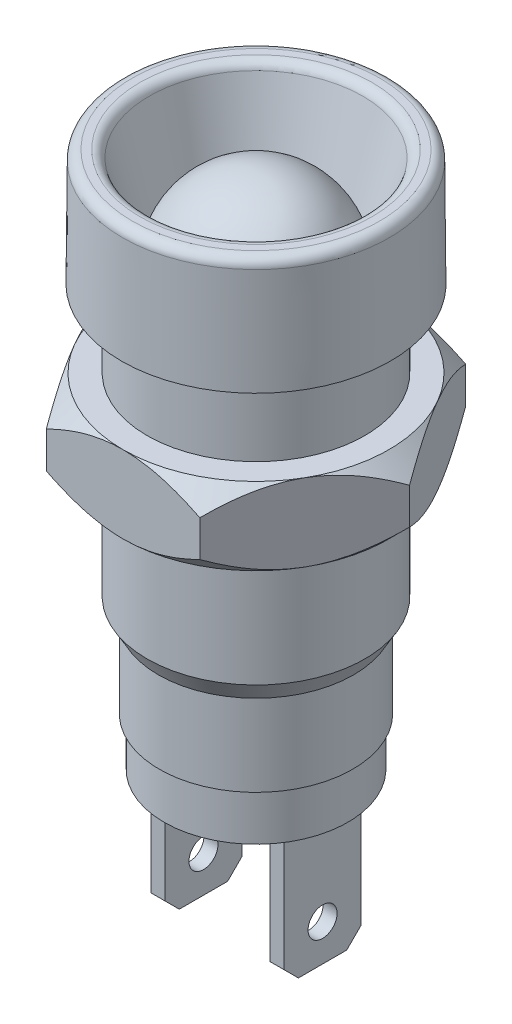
ISO-10303-21;
HEADER;
FILE_DESCRIPTION(('STEP AP214'),'2;1');
FILE_NAME('part.step','',(''),(''),'','','');
FILE_SCHEMA(('AUTOMOTIVE_DESIGN { 1 0 10303 214 1 1 1 1 }'));
ENDSEC;
DATA;
#1=APPLICATION_CONTEXT('core data for automotive mechanical design processes');
#2=APPLICATION_PROTOCOL_DEFINITION('international standard','automotive_design',2000,#1);
#3=PRODUCT_CONTEXT('',#1,'mechanical');
#4=PRODUCT('Part','Part','',(#3));
#5=PRODUCT_RELATED_PRODUCT_CATEGORY('part','',(#4));
#6=PRODUCT_DEFINITION_FORMATION('','',#4);
#7=PRODUCT_DEFINITION_CONTEXT('part definition',#1,'design');
#8=PRODUCT_DEFINITION('design','',#6,#7);
#9=PRODUCT_DEFINITION_SHAPE('','',#8);
#10=(LENGTH_UNIT() NAMED_UNIT(*) SI_UNIT(.MILLI.,.METRE.));
#11=(NAMED_UNIT(*) PLANE_ANGLE_UNIT() SI_UNIT($,.RADIAN.));
#12=(NAMED_UNIT(*) SI_UNIT($,.STERADIAN.) SOLID_ANGLE_UNIT());
#13=UNCERTAINTY_MEASURE_WITH_UNIT(LENGTH_MEASURE(1.E-05),#10,'distance_accuracy_value','');
#14=(GEOMETRIC_REPRESENTATION_CONTEXT(3) GLOBAL_UNCERTAINTY_ASSIGNED_CONTEXT((#13)) GLOBAL_UNIT_ASSIGNED_CONTEXT((#10,
#11,#12)) REPRESENTATION_CONTEXT('',''));
#15=CARTESIAN_POINT('',(0.,0.,0.));
#16=DIRECTION('',(0.,0.,1.));
#17=DIRECTION('',(1.,0.,0.));
#18=AXIS2_PLACEMENT_3D('',#15,#16,#17);
#19=CARTESIAN_POINT('',(0.,-7.62,0.));
#20=DIRECTION('',(0.,1.,0.));
#21=DIRECTION('',(0.,0.,1.));
#22=AXIS2_PLACEMENT_3D('',#19,#20,#21);
#23=CYLINDRICAL_SURFACE('',#22,2.8575);
#24=CARTESIAN_POINT('',(0.,-7.112,0.));
#25=DIRECTION('',(0.,-1.,0.));
#26=DIRECTION('',(0.,0.,-1.));
#27=AXIS2_PLACEMENT_3D('',#24,#25,#26);
#28=CIRCLE('',#27,2.8575);
#29=CARTESIAN_POINT('',(0.,-7.112,2.8575));
#30=VERTEX_POINT('',#29);
#31=EDGE_CURVE('E465',#30,#30,#28,.F.);
#32=CARTESIAN_POINT('',(0.,-4.064,0.));
#33=DIRECTION('',(0.,1.,0.));
#34=DIRECTION('',(0.,0.,1.));
#35=AXIS2_PLACEMENT_3D('',#32,#33,#34);
#36=CIRCLE('',#35,2.8575);
#37=CARTESIAN_POINT('',(0.,-4.064,2.8575));
#38=VERTEX_POINT('',#37);
#39=EDGE_CURVE('E11',#38,#38,#36,.T.);
#40=CARTESIAN_POINT('',(0.,-7.112,2.8575));
#41=CARTESIAN_POINT('',(0.,-7.08025,2.8575));
#42=CARTESIAN_POINT('',(0.,-7.0485,2.8575));
#43=CARTESIAN_POINT('',(0.,-6.985,2.8575));
#44=CARTESIAN_POINT('',(0.,-6.95325,2.8575));
#45=CARTESIAN_POINT('',(0.,-6.88975,2.8575));
#46=CARTESIAN_POINT('',(0.,-6.858,2.8575));
#47=CARTESIAN_POINT('',(0.,-6.7945,2.8575));
#48=CARTESIAN_POINT('',(0.,-6.76275,2.8575));
#49=CARTESIAN_POINT('',(0.,-6.69925,2.8575));
#50=CARTESIAN_POINT('',(0.,-6.6675,2.8575));
#51=CARTESIAN_POINT('',(0.,-6.604,2.8575));
#52=CARTESIAN_POINT('',(0.,-6.57225,2.8575));
#53=CARTESIAN_POINT('',(0.,-6.50875,2.8575));
#54=CARTESIAN_POINT('',(0.,-6.477,2.8575));
#55=CARTESIAN_POINT('',(0.,-6.4135,2.8575));
#56=CARTESIAN_POINT('',(0.,-6.38175,2.8575));
#57=CARTESIAN_POINT('',(0.,-6.31825,2.8575));
#58=CARTESIAN_POINT('',(0.,-6.2865,2.8575));
#59=CARTESIAN_POINT('',(0.,-6.223,2.8575));
#60=CARTESIAN_POINT('',(0.,-6.19125,2.8575));
#61=CARTESIAN_POINT('',(0.,-6.12775,2.8575));
#62=CARTESIAN_POINT('',(0.,-6.096,2.8575));
#63=CARTESIAN_POINT('',(0.,-6.0325,2.8575));
#64=CARTESIAN_POINT('',(0.,-6.00075,2.8575));
#65=CARTESIAN_POINT('',(0.,-5.93725,2.8575));
#66=CARTESIAN_POINT('',(0.,-5.9055,2.8575));
#67=CARTESIAN_POINT('',(0.,-5.842,2.8575));
#68=CARTESIAN_POINT('',(0.,-5.81025,2.8575));
#69=CARTESIAN_POINT('',(0.,-5.74675,2.8575));
#70=CARTESIAN_POINT('',(0.,-5.715,2.8575));
#71=CARTESIAN_POINT('',(0.,-5.6515,2.8575));
#72=CARTESIAN_POINT('',(0.,-5.61975,2.8575));
#73=CARTESIAN_POINT('',(0.,-5.55625,2.8575));
#74=CARTESIAN_POINT('',(0.,-5.5245,2.8575));
#75=CARTESIAN_POINT('',(0.,-5.461,2.8575));
#76=CARTESIAN_POINT('',(0.,-5.42925,2.8575));
#77=CARTESIAN_POINT('',(0.,-5.36575,2.8575));
#78=CARTESIAN_POINT('',(0.,-5.334,2.8575));
#79=CARTESIAN_POINT('',(0.,-5.2705,2.8575));
#80=CARTESIAN_POINT('',(0.,-5.23875,2.8575));
#81=CARTESIAN_POINT('',(0.,-5.17525,2.8575));
#82=CARTESIAN_POINT('',(0.,-5.1435,2.8575));
#83=CARTESIAN_POINT('',(0.,-5.08,2.8575));
#84=CARTESIAN_POINT('',(0.,-5.04825,2.8575));
#85=CARTESIAN_POINT('',(0.,-4.98475,2.8575));
#86=CARTESIAN_POINT('',(0.,-4.953,2.8575));
#87=CARTESIAN_POINT('',(0.,-4.8895,2.8575));
#88=CARTESIAN_POINT('',(0.,-4.85775,2.8575));
#89=CARTESIAN_POINT('',(0.,-4.79425,2.8575));
#90=CARTESIAN_POINT('',(0.,-4.7625,2.8575));
#91=CARTESIAN_POINT('',(0.,-4.699,2.8575));
#92=CARTESIAN_POINT('',(0.,-4.66725,2.8575));
#93=CARTESIAN_POINT('',(0.,-4.60375,2.8575));
#94=CARTESIAN_POINT('',(0.,-4.572,2.8575));
#95=CARTESIAN_POINT('',(0.,-4.5085,2.8575));
#96=CARTESIAN_POINT('',(0.,-4.47675,2.8575));
#97=CARTESIAN_POINT('',(0.,-4.41325,2.8575));
#98=CARTESIAN_POINT('',(0.,-4.3815,2.8575));
#99=CARTESIAN_POINT('',(0.,-4.318,2.8575));
#100=CARTESIAN_POINT('',(0.,-4.28625,2.8575));
#101=CARTESIAN_POINT('',(0.,-4.22275,2.8575));
#102=CARTESIAN_POINT('',(0.,-4.191,2.8575));
#103=CARTESIAN_POINT('',(0.,-4.1275,2.8575));
#104=CARTESIAN_POINT('',(0.,-4.09575,2.8575));
#105=CARTESIAN_POINT('',(0.,-4.064,2.8575));
#106=B_SPLINE_CURVE_WITH_KNOTS('',3,(#40,#41,#42,#43,#44,#45,#46,#47,#48,#49,#50,#51,#52,#53,
#54,#55,#56,#57,#58,#59,#60,#61,#62,#63,#64,#65,#66,#67,#68,#69,#70,#71,#72,#73,#74,#75,#76,#77,
#78,#79,#80,#81,#82,#83,#84,#85,#86,#87,#88,#89,#90,#91,#92,#93,#94,#95,#96,#97,#98,#99,#100,
#101,#102,#103,#104,#105),.UNSPECIFIED.,.F.,.F.,(4,2,2,2,2,2,2,2,2,2,2,2,2,2,2,2,2,2,2,2,2,2,2,
2,2,2,2,2,2,2,2,2,4),(0.,0.0952499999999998,0.1905,0.28575,0.380999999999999,0.476249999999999,
0.571499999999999,0.666749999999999,0.761999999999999,0.857249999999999,0.952499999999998,
1.04775,1.143,1.23825,1.3335,1.42875,1.524,1.61925,1.7145,1.80975,1.905,2.00025,2.0955,2.19075,
2.286,2.38125,2.4765,2.57175,2.667,2.76225,2.8575,2.95275,3.048),.UNSPECIFIED.);
#107=EDGE_CURVE('BSEAM36',#30,#38,#106,.T.);
#108=ORIENTED_EDGE('',*,*,#31,.T.);
#109=ORIENTED_EDGE('',*,*,#39,.F.);
#110=ORIENTED_EDGE('',*,*,#107,.T.);
#111=ORIENTED_EDGE('',*,*,#107,.F.);
#112=EDGE_LOOP('',(#108,#110,#109,#111));
#113=FACE_BOUND('',#112,.T.);
#114=ADVANCED_FACE('F36',(#113),#23,.T.);
#115=CARTESIAN_POINT('',(0.,-11.049,0.));
#116=DIRECTION('',(0.,-1.,0.));
#117=DIRECTION('',(0.,0.,-1.));
#118=AXIS2_PLACEMENT_3D('',#115,#116,#117);
#119=PLANE('',#118);
#120=DIRECTION('',(-1.,0.,0.));
#121=VECTOR('',#120,1.);
#122=CARTESIAN_POINT('',(-1.38009514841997,-11.049,1.016));
#123=LINE('',#122,#121);
#124=CARTESIAN_POINT('',(-1.38009514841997,-11.049,1.016));
#125=VERTEX_POINT('',#124);
#126=CARTESIAN_POINT('',(-1.74856462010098,-11.049,1.016));
#127=VERTEX_POINT('',#126);
#128=EDGE_CURVE('E562',#125,#127,#123,.T.);
#129=ORIENTED_EDGE('',*,*,#128,.F.);
#130=DIRECTION('',(0.,0.,1.));
#131=VECTOR('',#130,1.);
#132=CARTESIAN_POINT('',(-1.38009514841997,-11.049,-1.016));
#133=LINE('',#132,#131);
#134=CARTESIAN_POINT('',(-1.38009514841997,-11.049,-1.016));
#135=VERTEX_POINT('',#134);
#136=EDGE_CURVE('E559',#135,#125,#133,.T.);
#137=ORIENTED_EDGE('',*,*,#136,.F.);
#138=DIRECTION('',(1.,0.,0.));
#139=VECTOR('',#138,1.);
#140=CARTESIAN_POINT('',(-1.38009514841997,-11.049,-1.016));
#141=LINE('',#140,#139);
#142=CARTESIAN_POINT('',(-1.74856462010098,-11.049,-1.016));
#143=VERTEX_POINT('',#142);
#144=EDGE_CURVE('E568',#143,#135,#141,.T.);
#145=ORIENTED_EDGE('',*,*,#144,.F.);
#146=DIRECTION('',(0.,0.,-1.));
#147=VECTOR('',#146,1.);
#148=CARTESIAN_POINT('',(-1.74856462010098,-11.049,-1.016));
#149=LINE('',#148,#147);
#150=EDGE_CURVE('E565',#127,#143,#149,.T.);
#151=ORIENTED_EDGE('',*,*,#150,.F.);
#152=EDGE_LOOP('',(#129,#137,#145,#151));
#153=FACE_BOUND('',#152,.T.);
#154=CARTESIAN_POINT('',(0.,-11.049,0.));
#155=DIRECTION('',(0.,-1.,0.));
#156=DIRECTION('',(0.,0.,-1.));
#157=AXIS2_PLACEMENT_3D('',#154,#155,#156);
#158=CIRCLE('',#157,2.413);
#159=CARTESIAN_POINT('',(0.,-11.049,-2.413));
#160=VERTEX_POINT('',#159);
#161=EDGE_CURVE('E588',#160,#160,#158,.T.);
#162=ORIENTED_EDGE('',*,*,#161,.T.);
#163=EDGE_LOOP('',(#162));
#164=FACE_BOUND('',#163,.T.);
#165=DIRECTION('',(0.,0.,1.));
#166=VECTOR('',#165,1.);
#167=CARTESIAN_POINT('',(1.74856462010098,-11.049,-1.016));
#168=LINE('',#167,#166);
#169=CARTESIAN_POINT('',(1.74856462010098,-11.049,-1.016));
#170=VERTEX_POINT('',#169);
#171=CARTESIAN_POINT('',(1.74856462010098,-11.049,1.016));
#172=VERTEX_POINT('',#171);
#173=EDGE_CURVE('E536',#170,#172,#168,.T.);
#174=ORIENTED_EDGE('',*,*,#173,.F.);
#175=DIRECTION('',(1.,0.,0.));
#176=VECTOR('',#175,1.);
#177=CARTESIAN_POINT('',(1.38009514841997,-11.049,-1.016));
#178=LINE('',#177,#176);
#179=CARTESIAN_POINT('',(1.38009514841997,-11.049,-1.016));
#180=VERTEX_POINT('',#179);
#181=EDGE_CURVE('E533',#180,#170,#178,.T.);
#182=ORIENTED_EDGE('',*,*,#181,.F.);
#183=DIRECTION('',(0.,0.,-1.));
#184=VECTOR('',#183,1.);
#185=CARTESIAN_POINT('',(1.38009514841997,-11.049,-1.016));
#186=LINE('',#185,#184);
#187=CARTESIAN_POINT('',(1.38009514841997,-11.049,1.016));
#188=VERTEX_POINT('',#187);
#189=EDGE_CURVE('E542',#188,#180,#186,.T.);
#190=ORIENTED_EDGE('',*,*,#189,.F.);
#191=DIRECTION('',(-1.,0.,0.));
#192=VECTOR('',#191,1.);
#193=CARTESIAN_POINT('',(1.38009514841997,-11.049,1.016));
#194=LINE('',#193,#192);
#195=EDGE_CURVE('E539',#172,#188,#194,.T.);
#196=ORIENTED_EDGE('',*,*,#195,.F.);
#197=EDGE_LOOP('',(#174,#182,#190,#196));
#198=FACE_BOUND('',#197,.T.);
#199=ADVANCED_FACE('F431',(#153,#164,#198),#119,.T.);
#200=CARTESIAN_POINT('',(0.,-9.779,0.));
#201=DIRECTION('',(0.,-1.,0.));
#202=DIRECTION('',(0.,0.,-1.));
#203=AXIS2_PLACEMENT_3D('',#200,#201,#202);
#204=PLANE('',#203);
#205=CARTESIAN_POINT('',(0.,-9.779,0.));
#206=DIRECTION('',(0.,-1.,0.));
#207=DIRECTION('',(0.,0.,-1.));
#208=AXIS2_PLACEMENT_3D('',#205,#206,#207);
#209=CIRCLE('',#208,2.54);
#210=CARTESIAN_POINT('',(0.,-9.779,-2.54));
#211=VERTEX_POINT('',#210);
#212=EDGE_CURVE('E594',#211,#211,#209,.T.);
#213=ORIENTED_EDGE('',*,*,#212,.T.);
#214=EDGE_LOOP('',(#213));
#215=FACE_BOUND('',#214,.T.);
#216=CARTESIAN_POINT('',(0.,-9.779,0.));
#217=DIRECTION('',(0.,-1.,0.));
#218=DIRECTION('',(0.,0.,-1.));
#219=AXIS2_PLACEMENT_3D('',#216,#217,#218);
#220=CIRCLE('',#219,2.413);
#221=CARTESIAN_POINT('',(0.,-9.779,-2.413));
#222=VERTEX_POINT('',#221);
#223=EDGE_CURVE('E585',#222,#222,#220,.T.);
#224=ORIENTED_EDGE('',*,*,#223,.F.);
#225=EDGE_LOOP('',(#224));
#226=FACE_BOUND('',#225,.T.);
#227=ADVANCED_FACE('F438',(#215,#226),#204,.T.);
#228=CARTESIAN_POINT('',(0.,-7.62,0.));
#229=DIRECTION('',(0.,-1.,0.));
#230=DIRECTION('',(0.,0.,-1.));
#231=AXIS2_PLACEMENT_3D('',#228,#229,#230);
#232=PLANE('',#231);
#233=CARTESIAN_POINT('',(0.,-7.62,0.));
#234=DIRECTION('',(0.,-1.,0.));
#235=DIRECTION('',(0.,0.,-1.));
#236=AXIS2_PLACEMENT_3D('',#233,#234,#235);
#237=CIRCLE('',#236,2.56420606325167);
#238=CARTESIAN_POINT('',(0.,-7.62,-2.56420606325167));
#239=VERTEX_POINT('',#238);
#240=EDGE_CURVE('E461',#239,#239,#237,.T.);
#241=ORIENTED_EDGE('',*,*,#240,.T.);
#242=EDGE_LOOP('',(#241));
#243=FACE_BOUND('',#242,.T.);
#244=CARTESIAN_POINT('',(0.,-7.62,0.));
#245=DIRECTION('',(0.,-1.,0.));
#246=DIRECTION('',(0.,0.,-1.));
#247=AXIS2_PLACEMENT_3D('',#244,#245,#246);
#248=CIRCLE('',#247,2.54);
#249=CARTESIAN_POINT('',(0.,-7.62,-2.54));
#250=VERTEX_POINT('',#249);
#251=EDGE_CURVE('E591',#250,#250,#248,.T.);
#252=ORIENTED_EDGE('',*,*,#251,.F.);
#253=EDGE_LOOP('',(#252));
#254=FACE_BOUND('',#253,.T.);
#255=ADVANCED_FACE('F645',(#243,#254),#232,.T.);
#256=CARTESIAN_POINT('',(0.,-7.62,0.));
#257=DIRECTION('',(0.,1.,0.));
#258=DIRECTION('',(0.,0.,1.));
#259=AXIS2_PLACEMENT_3D('',#256,#257,#258);
#260=CONICAL_SURFACE('',#259,2.56420606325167,0.523598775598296);
#261=ORIENTED_EDGE('',*,*,#31,.F.);
#262=EDGE_LOOP('',(#261));
#263=FACE_BOUND('',#262,.T.);
#264=ORIENTED_EDGE('',*,*,#240,.F.);
#265=EDGE_LOOP('',(#264));
#266=FACE_BOUND('',#265,.T.);
#267=ADVANCED_FACE('F648',(#263,#266),#260,.T.);
#268=CARTESIAN_POINT('',(0.,-9.779,0.));
#269=DIRECTION('',(0.,1.,0.));
#270=DIRECTION('',(0.,0.,1.));
#271=AXIS2_PLACEMENT_3D('',#268,#269,#270);
#272=CYLINDRICAL_SURFACE('',#271,2.54);
#273=ORIENTED_EDGE('',*,*,#212,.F.);
#274=EDGE_LOOP('',(#273));
#275=FACE_BOUND('',#274,.T.);
#276=ORIENTED_EDGE('',*,*,#251,.T.);
#277=EDGE_LOOP('',(#276));
#278=FACE_BOUND('',#277,.T.);
#279=ADVANCED_FACE('F641',(#275,#278),#272,.T.);
#280=CARTESIAN_POINT('',(0.,-11.049,0.));
#281=DIRECTION('',(0.,1.,0.));
#282=DIRECTION('',(0.,0.,1.));
#283=AXIS2_PLACEMENT_3D('',#280,#281,#282);
#284=CYLINDRICAL_SURFACE('',#283,2.413);
#285=ORIENTED_EDGE('',*,*,#161,.F.);
#286=EDGE_LOOP('',(#285));
#287=FACE_BOUND('',#286,.T.);
#288=ORIENTED_EDGE('',*,*,#223,.T.);
#289=EDGE_LOOP('',(#288));
#290=FACE_BOUND('',#289,.T.);
#291=ADVANCED_FACE('F637',(#287,#290),#284,.T.);
#292=CARTESIAN_POINT('',(-1.38009514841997,-14.605,-1.016));
#293=DIRECTION('',(-1.,0.,0.));
#294=DIRECTION('',(0.,0.,1.));
#295=AXIS2_PLACEMENT_3D('',#292,#293,#294);
#296=PLANE('',#295);
#297=CARTESIAN_POINT('',(-1.38009514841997,-13.6410093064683,0.));
#298=DIRECTION('',(-1.,0.,0.));
#299=DIRECTION('',(0.,0.,1.));
#300=AXIS2_PLACEMENT_3D('',#297,#298,#299);
#301=CIRCLE('',#300,0.381);
#302=CARTESIAN_POINT('',(-1.38009514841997,-13.6410093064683,0.381));
#303=VERTEX_POINT('',#302);
#304=EDGE_CURVE('E525',#303,#303,#301,.T.);
#305=ORIENTED_EDGE('',*,*,#304,.T.);
#306=EDGE_LOOP('',(#305));
#307=FACE_BOUND('',#306,.T.);
#308=DIRECTION('',(0.,1.,0.));
#309=VECTOR('',#308,1.);
#310=CARTESIAN_POINT('',(-1.38009514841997,-14.605,1.016));
#311=LINE('',#310,#309);
#312=CARTESIAN_POINT('',(-1.38009514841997,-14.224,1.016));
#313=VERTEX_POINT('',#312);
#314=EDGE_CURVE('E583',#313,#125,#311,.T.);
#315=ORIENTED_EDGE('',*,*,#314,.F.);
#316=DIRECTION('',(0.,-0.707106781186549,-0.707106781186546));
#317=VECTOR('',#316,1.);
#318=CARTESIAN_POINT('',(-1.38009514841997,-14.605,0.635000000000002));
#319=LINE('',#318,#317);
#320=CARTESIAN_POINT('',(-1.38009514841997,-14.605,0.635000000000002));
#321=VERTEX_POINT('',#320);
#322=EDGE_CURVE('E515',#313,#321,#319,.T.);
#323=ORIENTED_EDGE('',*,*,#322,.T.);
#324=DIRECTION('',(0.,0.,1.));
#325=VECTOR('',#324,1.);
#326=CARTESIAN_POINT('',(-1.38009514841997,-14.605,-1.016));
#327=LINE('',#326,#325);
#328=CARTESIAN_POINT('',(-1.38009514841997,-14.605,-0.635000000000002));
#329=VERTEX_POINT('',#328);
#330=EDGE_CURVE('E571',#329,#321,#327,.T.);
#331=ORIENTED_EDGE('',*,*,#330,.F.);
#332=DIRECTION('',(0.,0.707106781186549,-0.707106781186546));
#333=VECTOR('',#332,1.);
#334=CARTESIAN_POINT('',(-1.38009514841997,-14.605,-0.635000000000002));
#335=LINE('',#334,#333);
#336=CARTESIAN_POINT('',(-1.38009514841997,-14.224,-1.016));
#337=VERTEX_POINT('',#336);
#338=EDGE_CURVE('E52',#329,#337,#335,.T.);
#339=ORIENTED_EDGE('',*,*,#338,.T.);
#340=DIRECTION('',(0.,1.,0.));
#341=VECTOR('',#340,1.);
#342=CARTESIAN_POINT('',(-1.38009514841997,-14.605,-1.016));
#343=LINE('',#342,#341);
#344=EDGE_CURVE('E577',#337,#135,#343,.T.);
#345=ORIENTED_EDGE('',*,*,#344,.T.);
#346=ORIENTED_EDGE('',*,*,#136,.T.);
#347=EDGE_LOOP('',(#315,#323,#331,#339,#345,#346));
#348=FACE_BOUND('',#347,.T.);
#349=ADVANCED_FACE('F640',(#307,#348),#296,.F.);
#350=CARTESIAN_POINT('',(-1.38009514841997,-14.605,1.016));
#351=DIRECTION('',(0.,0.,-1.));
#352=DIRECTION('',(-1.,0.,0.));
#353=AXIS2_PLACEMENT_3D('',#350,#351,#352);
#354=PLANE('',#353);
#355=DIRECTION('',(0.,1.,0.));
#356=VECTOR('',#355,1.);
#357=CARTESIAN_POINT('',(-1.74856462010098,-14.605,1.016));
#358=LINE('',#357,#356);
#359=CARTESIAN_POINT('',(-1.74856462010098,-14.224,1.016));
#360=VERTEX_POINT('',#359);
#361=EDGE_CURVE('E581',#360,#127,#358,.T.);
#362=ORIENTED_EDGE('',*,*,#361,.F.);
#363=DIRECTION('',(1.,0.,0.));
#364=VECTOR('',#363,1.);
#365=CARTESIAN_POINT('',(-1.38009514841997,-14.224,1.016));
#366=LINE('',#365,#364);
#367=EDGE_CURVE('E60',#360,#313,#366,.T.);
#368=ORIENTED_EDGE('',*,*,#367,.T.);
#369=ORIENTED_EDGE('',*,*,#314,.T.);
#370=ORIENTED_EDGE('',*,*,#128,.T.);
#371=EDGE_LOOP('',(#362,#368,#369,#370));
#372=FACE_BOUND('',#371,.T.);
#373=ADVANCED_FACE('F687',(#372),#354,.F.);
#374=CARTESIAN_POINT('',(-1.74856462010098,-14.605,-1.016));
#375=DIRECTION('',(1.,0.,0.));
#376=DIRECTION('',(0.,0.,-1.));
#377=AXIS2_PLACEMENT_3D('',#374,#375,#376);
#378=PLANE('',#377);
#379=CARTESIAN_POINT('',(-1.74856462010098,-13.6410093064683,0.));
#380=DIRECTION('',(-1.,0.,0.));
#381=DIRECTION('',(0.,0.,1.));
#382=AXIS2_PLACEMENT_3D('',#379,#380,#381);
#383=CIRCLE('',#382,0.381);
#384=CARTESIAN_POINT('',(-1.74856462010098,-13.6410093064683,0.381));
#385=VERTEX_POINT('',#384);
#386=EDGE_CURVE('E521',#385,#385,#383,.T.);
#387=ORIENTED_EDGE('',*,*,#386,.F.);
#388=EDGE_LOOP('',(#387));
#389=FACE_BOUND('',#388,.T.);
#390=DIRECTION('',(0.,0.,-1.));
#391=VECTOR('',#390,1.);
#392=CARTESIAN_POINT('',(-1.74856462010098,-14.605,-1.016));
#393=LINE('',#392,#391);
#394=CARTESIAN_POINT('',(-1.74856462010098,-14.605,0.635000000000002));
#395=VERTEX_POINT('',#394);
#396=CARTESIAN_POINT('',(-1.74856462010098,-14.605,-0.635000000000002));
#397=VERTEX_POINT('',#396);
#398=EDGE_CURVE('E574',#395,#397,#393,.T.);
#399=ORIENTED_EDGE('',*,*,#398,.F.);
#400=DIRECTION('',(0.,0.707106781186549,0.707106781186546));
#401=VECTOR('',#400,1.);
#402=CARTESIAN_POINT('',(-1.74856462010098,-14.605,0.635000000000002));
#403=LINE('',#402,#401);
#404=EDGE_CURVE('E511',#395,#360,#403,.T.);
#405=ORIENTED_EDGE('',*,*,#404,.T.);
#406=ORIENTED_EDGE('',*,*,#361,.T.);
#407=ORIENTED_EDGE('',*,*,#150,.T.);
#408=DIRECTION('',(0.,1.,0.));
#409=VECTOR('',#408,1.);
#410=CARTESIAN_POINT('',(-1.74856462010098,-14.605,-1.016));
#411=LINE('',#410,#409);
#412=CARTESIAN_POINT('',(-1.74856462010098,-14.224,-1.016));
#413=VERTEX_POINT('',#412);
#414=EDGE_CURVE('E579',#413,#143,#411,.T.);
#415=ORIENTED_EDGE('',*,*,#414,.F.);
#416=DIRECTION('',(0.,-0.707106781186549,0.707106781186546));
#417=VECTOR('',#416,1.);
#418=CARTESIAN_POINT('',(-1.74856462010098,-14.605,-0.635000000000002));
#419=LINE('',#418,#417);
#420=EDGE_CURVE('E509',#413,#397,#419,.T.);
#421=ORIENTED_EDGE('',*,*,#420,.T.);
#422=EDGE_LOOP('',(#399,#405,#406,#407,#415,#421));
#423=FACE_BOUND('',#422,.T.);
#424=ADVANCED_FACE('F696',(#389,#423),#378,.F.);
#425=CARTESIAN_POINT('',(-1.38009514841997,-14.605,-1.016));
#426=DIRECTION('',(0.,0.,1.));
#427=DIRECTION('',(1.,0.,0.));
#428=AXIS2_PLACEMENT_3D('',#425,#426,#427);
#429=PLANE('',#428);
#430=ORIENTED_EDGE('',*,*,#344,.F.);
#431=DIRECTION('',(-1.,0.,0.));
#432=VECTOR('',#431,1.);
#433=CARTESIAN_POINT('',(-1.74856462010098,-14.224,-1.016));
#434=LINE('',#433,#432);
#435=EDGE_CURVE('E45',#337,#413,#434,.T.);
#436=ORIENTED_EDGE('',*,*,#435,.T.);
#437=ORIENTED_EDGE('',*,*,#414,.T.);
#438=ORIENTED_EDGE('',*,*,#144,.T.);
#439=EDGE_LOOP('',(#430,#436,#437,#438));
#440=FACE_BOUND('',#439,.T.);
#441=ADVANCED_FACE('F704',(#440),#429,.F.);
#442=CARTESIAN_POINT('',(-1.38009514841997,-14.605,1.016));
#443=DIRECTION('',(0.,-1.,0.));
#444=DIRECTION('',(0.,0.,-1.));
#445=AXIS2_PLACEMENT_3D('',#442,#443,#444);
#446=PLANE('',#445);
#447=ORIENTED_EDGE('',*,*,#330,.T.);
#448=DIRECTION('',(-1.,0.,0.));
#449=VECTOR('',#448,1.);
#450=CARTESIAN_POINT('',(-1.74856462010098,-14.605,0.635000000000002));
#451=LINE('',#450,#449);
#452=EDGE_CURVE('E506',#321,#395,#451,.T.);
#453=ORIENTED_EDGE('',*,*,#452,.T.);
#454=ORIENTED_EDGE('',*,*,#398,.T.);
#455=DIRECTION('',(1.,0.,0.));
#456=VECTOR('',#455,1.);
#457=CARTESIAN_POINT('',(-1.38009514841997,-14.605,-0.635000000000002));
#458=LINE('',#457,#456);
#459=EDGE_CURVE('E503',#397,#329,#458,.T.);
#460=ORIENTED_EDGE('',*,*,#459,.T.);
#461=EDGE_LOOP('',(#447,#453,#454,#460));
#462=FACE_BOUND('',#461,.T.);
#463=ADVANCED_FACE('F712',(#462),#446,.T.);
#464=CARTESIAN_POINT('',(1.38009514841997,-14.605,-1.016));
#465=DIRECTION('',(0.,0.,1.));
#466=DIRECTION('',(1.,0.,0.));
#467=AXIS2_PLACEMENT_3D('',#464,#465,#466);
#468=PLANE('',#467);
#469=DIRECTION('',(0.,1.,0.));
#470=VECTOR('',#469,1.);
#471=CARTESIAN_POINT('',(1.74856462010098,-14.605,-1.016));
#472=LINE('',#471,#470);
#473=CARTESIAN_POINT('',(1.74856462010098,-14.224,-1.016));
#474=VERTEX_POINT('',#473);
#475=EDGE_CURVE('E557',#474,#170,#472,.T.);
#476=ORIENTED_EDGE('',*,*,#475,.F.);
#477=DIRECTION('',(-1.,0.,0.));
#478=VECTOR('',#477,1.);
#479=CARTESIAN_POINT('',(1.38009514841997,-14.224,-1.016));
#480=LINE('',#479,#478);
#481=CARTESIAN_POINT('',(1.38009514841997,-14.224,-1.016));
#482=VERTEX_POINT('',#481);
#483=EDGE_CURVE('E495',#474,#482,#480,.T.);
#484=ORIENTED_EDGE('',*,*,#483,.T.);
#485=DIRECTION('',(0.,1.,0.));
#486=VECTOR('',#485,1.);
#487=CARTESIAN_POINT('',(1.38009514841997,-14.605,-1.016));
#488=LINE('',#487,#486);
#489=EDGE_CURVE('E551',#482,#180,#488,.T.);
#490=ORIENTED_EDGE('',*,*,#489,.T.);
#491=ORIENTED_EDGE('',*,*,#181,.T.);
#492=EDGE_LOOP('',(#476,#484,#490,#491));
#493=FACE_BOUND('',#492,.T.);
#494=ADVANCED_FACE('F720',(#493),#468,.F.);
#495=CARTESIAN_POINT('',(1.74856462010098,-14.605,-1.016));
#496=DIRECTION('',(-1.,0.,0.));
#497=DIRECTION('',(0.,0.,1.));
#498=AXIS2_PLACEMENT_3D('',#495,#496,#497);
#499=PLANE('',#498);
#500=CARTESIAN_POINT('',(1.74856462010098,-13.6410093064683,0.));
#501=DIRECTION('',(-1.,0.,0.));
#502=DIRECTION('',(0.,0.,1.));
#503=AXIS2_PLACEMENT_3D('',#500,#501,#502);
#504=CIRCLE('',#503,0.381);
#505=CARTESIAN_POINT('',(1.74856462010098,-13.6410093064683,0.381));
#506=VERTEX_POINT('',#505);
#507=EDGE_CURVE('E520',#506,#506,#504,.T.);
#508=ORIENTED_EDGE('',*,*,#507,.T.);
#509=EDGE_LOOP('',(#508));
#510=FACE_BOUND('',#509,.T.);
#511=DIRECTION('',(0.,0.,1.));
#512=VECTOR('',#511,1.);
#513=CARTESIAN_POINT('',(1.74856462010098,-14.605,-1.016));
#514=LINE('',#513,#512);
#515=CARTESIAN_POINT('',(1.74856462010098,-14.605,-0.635000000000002));
#516=VERTEX_POINT('',#515);
#517=CARTESIAN_POINT('',(1.74856462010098,-14.605,0.635000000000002));
#518=VERTEX_POINT('',#517);
#519=EDGE_CURVE('E545',#516,#518,#514,.T.);
#520=ORIENTED_EDGE('',*,*,#519,.F.);
#521=DIRECTION('',(0.,0.707106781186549,-0.707106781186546));
#522=VECTOR('',#521,1.);
#523=CARTESIAN_POINT('',(1.74856462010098,-14.605,-0.635000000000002));
#524=LINE('',#523,#522);
#525=EDGE_CURVE('E493',#516,#474,#524,.T.);
#526=ORIENTED_EDGE('',*,*,#525,.T.);
#527=ORIENTED_EDGE('',*,*,#475,.T.);
#528=ORIENTED_EDGE('',*,*,#173,.T.);
#529=DIRECTION('',(0.,1.,0.));
#530=VECTOR('',#529,1.);
#531=CARTESIAN_POINT('',(1.74856462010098,-14.605,1.016));
#532=LINE('',#531,#530);
#533=CARTESIAN_POINT('',(1.74856462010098,-14.224,1.016));
#534=VERTEX_POINT('',#533);
#535=EDGE_CURVE('E555',#534,#172,#532,.T.);
#536=ORIENTED_EDGE('',*,*,#535,.F.);
#537=DIRECTION('',(0.,-0.707106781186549,-0.707106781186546));
#538=VECTOR('',#537,1.);
#539=CARTESIAN_POINT('',(1.74856462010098,-14.605,0.635000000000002));
#540=LINE('',#539,#538);
#541=EDGE_CURVE('E491',#534,#518,#540,.T.);
#542=ORIENTED_EDGE('',*,*,#541,.T.);
#543=EDGE_LOOP('',(#520,#526,#527,#528,#536,#542));
#544=FACE_BOUND('',#543,.T.);
#545=ADVANCED_FACE('F728',(#510,#544),#499,.F.);
#546=CARTESIAN_POINT('',(1.38009514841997,-14.605,1.016));
#547=DIRECTION('',(0.,0.,-1.));
#548=DIRECTION('',(-1.,0.,0.));
#549=AXIS2_PLACEMENT_3D('',#546,#547,#548);
#550=PLANE('',#549);
#551=DIRECTION('',(0.,1.,0.));
#552=VECTOR('',#551,1.);
#553=CARTESIAN_POINT('',(1.38009514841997,-14.605,1.016));
#554=LINE('',#553,#552);
#555=CARTESIAN_POINT('',(1.38009514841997,-14.224,1.016));
#556=VERTEX_POINT('',#555);
#557=EDGE_CURVE('E553',#556,#188,#554,.T.);
#558=ORIENTED_EDGE('',*,*,#557,.F.);
#559=DIRECTION('',(1.,0.,0.));
#560=VECTOR('',#559,1.);
#561=CARTESIAN_POINT('',(1.74856462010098,-14.224,1.016));
#562=LINE('',#561,#560);
#563=EDGE_CURVE('E501',#556,#534,#562,.T.);
#564=ORIENTED_EDGE('',*,*,#563,.T.);
#565=ORIENTED_EDGE('',*,*,#535,.T.);
#566=ORIENTED_EDGE('',*,*,#195,.T.);
#567=EDGE_LOOP('',(#558,#564,#565,#566));
#568=FACE_BOUND('',#567,.T.);
#569=ADVANCED_FACE('F736',(#568),#550,.F.);
#570=CARTESIAN_POINT('',(1.38009514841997,-14.605,-1.016));
#571=DIRECTION('',(1.,0.,0.));
#572=DIRECTION('',(0.,0.,-1.));
#573=AXIS2_PLACEMENT_3D('',#570,#571,#572);
#574=PLANE('',#573);
#575=CARTESIAN_POINT('',(1.38009514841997,-13.6410093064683,0.));
#576=DIRECTION('',(1.,0.,0.));
#577=DIRECTION('',(0.,0.,-1.));
#578=AXIS2_PLACEMENT_3D('',#575,#576,#577);
#579=CIRCLE('',#578,0.381);
#580=CARTESIAN_POINT('',(1.38009514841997,-13.6410093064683,-0.381));
#581=VERTEX_POINT('',#580);
#582=EDGE_CURVE('E518',#581,#581,#579,.T.);
#583=ORIENTED_EDGE('',*,*,#582,.T.);
#584=EDGE_LOOP('',(#583));
#585=FACE_BOUND('',#584,.T.);
#586=ORIENTED_EDGE('',*,*,#489,.F.);
#587=DIRECTION('',(0.,-0.707106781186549,0.707106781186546));
#588=VECTOR('',#587,1.);
#589=CARTESIAN_POINT('',(1.38009514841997,-14.605,-0.635000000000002));
#590=LINE('',#589,#588);
#591=CARTESIAN_POINT('',(1.38009514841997,-14.605,-0.635000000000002));
#592=VERTEX_POINT('',#591);
#593=EDGE_CURVE('E499',#482,#592,#590,.T.);
#594=ORIENTED_EDGE('',*,*,#593,.T.);
#595=DIRECTION('',(0.,0.,-1.));
#596=VECTOR('',#595,1.);
#597=CARTESIAN_POINT('',(1.38009514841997,-14.605,-1.016));
#598=LINE('',#597,#596);
#599=CARTESIAN_POINT('',(1.38009514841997,-14.605,0.635000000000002));
#600=VERTEX_POINT('',#599);
#601=EDGE_CURVE('E548',#600,#592,#598,.T.);
#602=ORIENTED_EDGE('',*,*,#601,.F.);
#603=DIRECTION('',(0.,0.707106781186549,0.707106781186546));
#604=VECTOR('',#603,1.);
#605=CARTESIAN_POINT('',(1.38009514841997,-14.605,0.635000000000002));
#606=LINE('',#605,#604);
#607=EDGE_CURVE('E497',#600,#556,#606,.T.);
#608=ORIENTED_EDGE('',*,*,#607,.T.);
#609=ORIENTED_EDGE('',*,*,#557,.T.);
#610=ORIENTED_EDGE('',*,*,#189,.T.);
#611=EDGE_LOOP('',(#586,#594,#602,#608,#609,#610));
#612=FACE_BOUND('',#611,.T.);
#613=ADVANCED_FACE('F744',(#585,#612),#574,.F.);
#614=CARTESIAN_POINT('',(1.74856462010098,-14.605,-1.016));
#615=DIRECTION('',(0.,-1.,0.));
#616=DIRECTION('',(0.,0.,-1.));
#617=AXIS2_PLACEMENT_3D('',#614,#615,#616);
#618=PLANE('',#617);
#619=ORIENTED_EDGE('',*,*,#601,.T.);
#620=DIRECTION('',(1.,0.,0.));
#621=VECTOR('',#620,1.);
#622=CARTESIAN_POINT('',(1.74856462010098,-14.605,-0.635000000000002));
#623=LINE('',#622,#621);
#624=EDGE_CURVE('E488',#592,#516,#623,.T.);
#625=ORIENTED_EDGE('',*,*,#624,.T.);
#626=ORIENTED_EDGE('',*,*,#519,.T.);
#627=DIRECTION('',(-1.,0.,0.));
#628=VECTOR('',#627,1.);
#629=CARTESIAN_POINT('',(1.38009514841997,-14.605,0.635000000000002));
#630=LINE('',#629,#628);
#631=EDGE_CURVE('E485',#518,#600,#630,.T.);
#632=ORIENTED_EDGE('',*,*,#631,.T.);
#633=EDGE_LOOP('',(#619,#625,#626,#632));
#634=FACE_BOUND('',#633,.T.);
#635=ADVANCED_FACE('F752',(#634),#618,.T.);
#636=CARTESIAN_POINT('',(1.74856462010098,-14.605,-0.635000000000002));
#637=DIRECTION('',(0.,-0.707106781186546,-0.707106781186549));
#638=DIRECTION('',(0.,0.707106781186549,-0.707106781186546));
#639=AXIS2_PLACEMENT_3D('',#636,#637,#638);
#640=PLANE('',#639);
#641=ORIENTED_EDGE('',*,*,#593,.F.);
#642=ORIENTED_EDGE('',*,*,#483,.F.);
#643=ORIENTED_EDGE('',*,*,#525,.F.);
#644=ORIENTED_EDGE('',*,*,#624,.F.);
#645=EDGE_LOOP('',(#641,#642,#643,#644));
#646=FACE_BOUND('',#645,.T.);
#647=ADVANCED_FACE('F759',(#646),#640,.T.);
#648=CARTESIAN_POINT('',(1.74856462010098,-14.605,0.635000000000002));
#649=DIRECTION('',(0.,-0.707106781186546,0.707106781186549));
#650=DIRECTION('',(0.,-0.707106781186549,-0.707106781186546));
#651=AXIS2_PLACEMENT_3D('',#648,#649,#650);
#652=PLANE('',#651);
#653=ORIENTED_EDGE('',*,*,#541,.F.);
#654=ORIENTED_EDGE('',*,*,#563,.F.);
#655=ORIENTED_EDGE('',*,*,#607,.F.);
#656=ORIENTED_EDGE('',*,*,#631,.F.);
#657=EDGE_LOOP('',(#653,#654,#655,#656));
#658=FACE_BOUND('',#657,.T.);
#659=ADVANCED_FACE('F767',(#658),#652,.T.);
#660=CARTESIAN_POINT('',(-1.38009514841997,-14.605,0.635000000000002));
#661=DIRECTION('',(0.,-0.707106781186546,0.707106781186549));
#662=DIRECTION('',(0.,-0.707106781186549,-0.707106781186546));
#663=AXIS2_PLACEMENT_3D('',#660,#661,#662);
#664=PLANE('',#663);
#665=ORIENTED_EDGE('',*,*,#322,.F.);
#666=ORIENTED_EDGE('',*,*,#367,.F.);
#667=ORIENTED_EDGE('',*,*,#404,.F.);
#668=ORIENTED_EDGE('',*,*,#452,.F.);
#669=EDGE_LOOP('',(#665,#666,#667,#668));
#670=FACE_BOUND('',#669,.T.);
#671=ADVANCED_FACE('F775',(#670),#664,.T.);
#672=CARTESIAN_POINT('',(-1.38009514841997,-14.605,-0.635000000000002));
#673=DIRECTION('',(0.,-0.707106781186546,-0.707106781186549));
#674=DIRECTION('',(0.,0.707106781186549,-0.707106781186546));
#675=AXIS2_PLACEMENT_3D('',#672,#673,#674);
#676=PLANE('',#675);
#677=ORIENTED_EDGE('',*,*,#420,.F.);
#678=ORIENTED_EDGE('',*,*,#435,.F.);
#679=ORIENTED_EDGE('',*,*,#338,.F.);
#680=ORIENTED_EDGE('',*,*,#459,.F.);
#681=EDGE_LOOP('',(#677,#678,#679,#680));
#682=FACE_BOUND('',#681,.T.);
#683=ADVANCED_FACE('F783',(#682),#676,.T.);
#684=CARTESIAN_POINT('',(3.5306,-13.6410093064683,0.));
#685=DIRECTION('',(-1.,0.,0.));
#686=DIRECTION('',(0.,0.,1.));
#687=AXIS2_PLACEMENT_3D('',#684,#685,#686);
#688=CYLINDRICAL_SURFACE('',#687,0.381);
#689=ORIENTED_EDGE('',*,*,#582,.F.);
#690=EDGE_LOOP('',(#689));
#691=FACE_BOUND('',#690,.T.);
#692=ORIENTED_EDGE('',*,*,#507,.F.);
#693=EDGE_LOOP('',(#692));
#694=FACE_BOUND('',#693,.T.);
#695=ADVANCED_FACE('F790',(#691,#694),#688,.F.);
#696=ORIENTED_EDGE('',*,*,#386,.T.);
#697=EDGE_LOOP('',(#696));
#698=FACE_BOUND('',#697,.T.);
#699=ORIENTED_EDGE('',*,*,#304,.F.);
#700=EDGE_LOOP('',(#699));
#701=FACE_BOUND('',#700,.T.);
#702=ADVANCED_FACE('F304',(#698,#701),#688,.F.);
#703=CARTESIAN_POINT('',(-4.03279163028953,-2.032,0.));
#704=DIRECTION('',(0.,1.,0.));
#705=DIRECTION('',(0.,0.,1.));
#706=AXIS2_PLACEMENT_3D('',#703,#704,#705);
#707=PLANE('',#706);
#708=CARTESIAN_POINT('',(0.,-2.032,0.));
#709=DIRECTION('',(0.,-1.,0.));
#710=DIRECTION('',(0.,0.,-1.));
#711=AXIS2_PLACEMENT_3D('',#708,#709,#710);
#712=CIRCLE('',#711,3.4925);
#713=CARTESIAN_POINT('',(0.,-2.032,3.4925));
#714=VERTEX_POINT('',#713);
#715=CARTESIAN_POINT('',(-3.02459372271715,-2.032,1.74625));
#716=VERTEX_POINT('',#715);
#717=EDGE_CURVE('E363',#714,#716,#712,.T.);
#718=ORIENTED_EDGE('',*,*,#717,.F.);
#719=CARTESIAN_POINT('',(3.02459372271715,-2.032,1.74624999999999));
#720=VERTEX_POINT('',#719);
#721=EDGE_CURVE('E360',#720,#714,#712,.T.);
#722=ORIENTED_EDGE('',*,*,#721,.F.);
#723=CARTESIAN_POINT('',(3.02459372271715,-2.032,-1.74624999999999));
#724=VERTEX_POINT('',#723);
#725=EDGE_CURVE('E354',#724,#720,#712,.T.);
#726=ORIENTED_EDGE('',*,*,#725,.F.);
#727=CARTESIAN_POINT('',(0.,-2.032,-3.4925));
#728=VERTEX_POINT('',#727);
#729=EDGE_CURVE('E352',#728,#724,#712,.T.);
#730=ORIENTED_EDGE('',*,*,#729,.F.);
#731=CARTESIAN_POINT('',(-3.02459372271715,-2.032,-1.74625));
#732=VERTEX_POINT('',#731);
#733=EDGE_CURVE('E355',#732,#728,#712,.T.);
#734=ORIENTED_EDGE('',*,*,#733,.F.);
#735=EDGE_CURVE('E205',#716,#732,#712,.T.);
#736=ORIENTED_EDGE('',*,*,#735,.F.);
#737=EDGE_LOOP('',(#718,#722,#726,#730,#734,#736));
#738=FACE_BOUND('',#737,.T.);
#739=CARTESIAN_POINT('',(0.,-2.032,0.));
#740=DIRECTION('',(0.,1.,0.));
#741=DIRECTION('',(0.,0.,1.));
#742=AXIS2_PLACEMENT_3D('',#739,#740,#741);
#743=CIRCLE('',#742,2.8575);
#744=CARTESIAN_POINT('',(0.,-2.032,2.8575));
#745=VERTEX_POINT('',#744);
#746=EDGE_CURVE('E40',#745,#745,#743,.T.);
#747=ORIENTED_EDGE('',*,*,#746,.F.);
#748=EDGE_LOOP('',(#747));
#749=FACE_BOUND('',#748,.T.);
#750=ADVANCED_FACE('F327',(#738,#749),#707,.T.);
#751=CARTESIAN_POINT('',(-4.03279163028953,-4.064,0.));
#752=DIRECTION('',(0.,1.,0.));
#753=DIRECTION('',(0.,0.,1.));
#754=AXIS2_PLACEMENT_3D('',#751,#752,#753);
#755=PLANE('',#754);
#756=CARTESIAN_POINT('',(0.,-4.064,0.));
#757=DIRECTION('',(0.,-1.,0.));
#758=DIRECTION('',(0.,0.,-1.));
#759=AXIS2_PLACEMENT_3D('',#756,#757,#758);
#760=CIRCLE('',#759,3.4925);
#761=CARTESIAN_POINT('',(3.02459372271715,-4.064,1.74624999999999));
#762=VERTEX_POINT('',#761);
#763=CARTESIAN_POINT('',(0.,-4.064,3.4925));
#764=VERTEX_POINT('',#763);
#765=EDGE_CURVE('E420',#762,#764,#760,.T.);
#766=ORIENTED_EDGE('',*,*,#765,.T.);
#767=CARTESIAN_POINT('',(-3.02459372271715,-4.064,1.74625));
#768=VERTEX_POINT('',#767);
#769=EDGE_CURVE('E415',#764,#768,#760,.T.);
#770=ORIENTED_EDGE('',*,*,#769,.T.);
#771=CARTESIAN_POINT('',(-3.02459372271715,-4.064,-1.74625));
#772=VERTEX_POINT('',#771);
#773=EDGE_CURVE('E419',#768,#772,#760,.T.);
#774=ORIENTED_EDGE('',*,*,#773,.T.);
#775=CARTESIAN_POINT('',(0.,-4.064,-3.4925));
#776=VERTEX_POINT('',#775);
#777=EDGE_CURVE('E376',#772,#776,#760,.T.);
#778=ORIENTED_EDGE('',*,*,#777,.T.);
#779=CARTESIAN_POINT('',(3.02459372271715,-4.064,-1.74624999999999));
#780=VERTEX_POINT('',#779);
#781=EDGE_CURVE('E322',#776,#780,#760,.T.);
#782=ORIENTED_EDGE('',*,*,#781,.T.);
#783=EDGE_CURVE('E421',#780,#762,#760,.T.);
#784=ORIENTED_EDGE('',*,*,#783,.T.);
#785=EDGE_LOOP('',(#766,#770,#774,#778,#782,#784));
#786=FACE_BOUND('',#785,.T.);
#787=ORIENTED_EDGE('',*,*,#39,.T.);
#788=EDGE_LOOP('',(#787));
#789=FACE_BOUND('',#788,.T.);
#790=ADVANCED_FACE('F264',(#786,#789),#755,.F.);
#791=CARTESIAN_POINT('',(-2.01639581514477,-2.032,3.4925));
#792=DIRECTION('',(-0.866025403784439,0.,0.5));
#793=DIRECTION('',(0.5,0.,0.866025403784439));
#794=AXIS2_PLACEMENT_3D('',#791,#792,#793);
#795=PLANE('',#794);
#796=CARTESIAN_POINT('',(-4.03290710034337,-2.57240710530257,-0.000200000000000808));
#797=CARTESIAN_POINT('',(-3.96359563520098,-2.50315624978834,0.119850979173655));
#798=CARTESIAN_POINT('',(-3.89312520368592,-2.43797274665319,0.241909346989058));
#799=CARTESIAN_POINT('',(-3.74942835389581,-2.31862356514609,0.490799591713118));
#800=CARTESIAN_POINT('',(-3.67618827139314,-2.2645242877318,0.617655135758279));
#801=CARTESIAN_POINT('',(-3.52850317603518,-2.17185130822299,0.873453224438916));
#802=CARTESIAN_POINT('',(-3.45409576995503,-2.13304468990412,1.00233063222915));
#803=CARTESIAN_POINT('',(-3.30364293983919,-2.07325521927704,1.26292257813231));
#804=CARTESIAN_POINT('',(-3.22760211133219,-2.05222773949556,1.39462915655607));
#805=CARTESIAN_POINT('',(-3.09654815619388,-2.03325530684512,1.62162126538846));
#806=CARTESIAN_POINT('',(-3.04170426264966,-2.03044692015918,1.71661367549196));
#807=CARTESIAN_POINT('',(-2.93210569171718,-2.03517973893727,1.90644396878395));
#808=CARTESIAN_POINT('',(-2.87735105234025,-2.04272457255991,2.0012817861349));
#809=CARTESIAN_POINT('',(-2.76836052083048,-2.06773303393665,2.19005892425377));
#810=CARTESIAN_POINT('',(-2.71412527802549,-2.085207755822,2.28399712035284));
#811=CARTESIAN_POINT('',(-2.60658626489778,-2.12912219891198,2.47026015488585));
#812=CARTESIAN_POINT('',(-2.5532824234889,-2.15556123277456,2.56258511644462));
#813=CARTESIAN_POINT('',(-2.45865383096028,-2.2099576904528,2.72648664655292));
#814=CARTESIAN_POINT('',(-2.41711960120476,-2.23648507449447,2.79842604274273));
#815=CARTESIAN_POINT('',(-2.33479678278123,-2.29381506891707,2.94101334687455));
#816=CARTESIAN_POINT('',(-2.29400821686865,-2.32461780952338,3.01166121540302));
#817=CARTESIAN_POINT('',(-2.21330523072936,-2.38980796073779,3.15144288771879));
#818=CARTESIAN_POINT('',(-2.17338851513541,-2.42418409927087,3.22058066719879));
#819=CARTESIAN_POINT('',(-2.09429432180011,-2.49606960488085,3.3575758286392));
#820=CARTESIAN_POINT('',(-2.05511640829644,-2.53357704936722,3.42543396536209));
#821=CARTESIAN_POINT('',(-2.01628034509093,-2.57240710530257,3.4927));
#822=B_SPLINE_CURVE_WITH_KNOTS('',3,(#796,#797,#798,#799,#800,#801,#802,#803,#804,#805,#806,
#807,#808,#809,#810,#811,#812,#813,#814,#815,#816,#817,#818,#819,#820,#821),.UNSPECIFIED.,.F.,
.F.,(4,2,2,2,2,2,2,2,2,2,2,2,4),(0.,0.465196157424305,0.933102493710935,1.39357805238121,
1.85289430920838,2.18160016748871,2.51042124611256,2.83961042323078,3.16877436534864,
3.43025569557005,3.69174499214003,3.95243312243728,4.21296235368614),.UNSPECIFIED.);
#823=CARTESIAN_POINT('',(-4.03279163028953,-2.57229163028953,0.));
#824=VERTEX_POINT('',#823);
#825=EDGE_CURVE('E203',#824,#716,#822,.T.);
#826=ORIENTED_EDGE('',*,*,#825,.F.);
#827=DIRECTION('',(0.,-1.,0.));
#828=VECTOR('',#827,1.);
#829=CARTESIAN_POINT('',(-4.03279163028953,-2.032,0.));
#830=LINE('',#829,#828);
#831=CARTESIAN_POINT('',(-4.03279163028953,-3.52370836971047,0.));
#832=VERTEX_POINT('',#831);
#833=EDGE_CURVE('E215',#824,#832,#830,.T.);
#834=ORIENTED_EDGE('',*,*,#833,.T.);
#835=CARTESIAN_POINT('',(-4.03290710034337,-3.52359289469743,-0.000200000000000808));
#836=CARTESIAN_POINT('',(-3.96359563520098,-3.59284375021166,0.119850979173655));
#837=CARTESIAN_POINT('',(-3.89312520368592,-3.65802725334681,0.241909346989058));
#838=CARTESIAN_POINT('',(-3.74942835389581,-3.77737643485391,0.490799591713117));
#839=CARTESIAN_POINT('',(-3.67618827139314,-3.8314757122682,0.617655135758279));
#840=CARTESIAN_POINT('',(-3.52850317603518,-3.92414869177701,0.873453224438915));
#841=CARTESIAN_POINT('',(-3.45409576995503,-3.96295531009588,1.00233063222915));
#842=CARTESIAN_POINT('',(-3.30364293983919,-4.02274478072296,1.2629225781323));
#843=CARTESIAN_POINT('',(-3.22760211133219,-4.04377226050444,1.39462915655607));
#844=CARTESIAN_POINT('',(-3.09654815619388,-4.06274469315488,1.62162126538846));
#845=CARTESIAN_POINT('',(-3.04170426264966,-4.06555307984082,1.71661367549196));
#846=CARTESIAN_POINT('',(-2.93210569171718,-4.06082026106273,1.90644396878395));
#847=CARTESIAN_POINT('',(-2.87735105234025,-4.05327542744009,2.0012817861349));
#848=CARTESIAN_POINT('',(-2.76836052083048,-4.02826696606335,2.19005892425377));
#849=CARTESIAN_POINT('',(-2.71412527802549,-4.010792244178,2.28399712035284));
#850=CARTESIAN_POINT('',(-2.60658626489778,-3.96687780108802,2.47026015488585));
#851=CARTESIAN_POINT('',(-2.5532824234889,-3.94043876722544,2.56258511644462));
#852=CARTESIAN_POINT('',(-2.45865383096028,-3.8860423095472,2.72648664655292));
#853=CARTESIAN_POINT('',(-2.41711960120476,-3.85951492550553,2.79842604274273));
#854=CARTESIAN_POINT('',(-2.33479678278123,-3.80218493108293,2.94101334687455));
#855=CARTESIAN_POINT('',(-2.29400821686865,-3.77138219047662,3.01166121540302));
#856=CARTESIAN_POINT('',(-2.21330523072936,-3.70619203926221,3.15144288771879));
#857=CARTESIAN_POINT('',(-2.17338851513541,-3.67181590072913,3.22058066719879));
#858=CARTESIAN_POINT('',(-2.09429432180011,-3.59993039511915,3.3575758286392));
#859=CARTESIAN_POINT('',(-2.05511640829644,-3.56242295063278,3.42543396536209));
#860=CARTESIAN_POINT('',(-2.01628034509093,-3.52359289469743,3.4927));
#861=B_SPLINE_CURVE_WITH_KNOTS('',3,(#835,#836,#837,#838,#839,#840,#841,#842,#843,#844,#845,
#846,#847,#848,#849,#850,#851,#852,#853,#854,#855,#856,#857,#858,#859,#860),.UNSPECIFIED.,.F.,
.F.,(4,2,2,2,2,2,2,2,2,2,2,2,4),(0.,0.465196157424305,0.933102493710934,1.39357805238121,
1.85289430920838,2.18160016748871,2.51042124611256,2.83961042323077,3.16877436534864,
3.43025569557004,3.69174499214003,3.95243312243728,4.21296235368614),.UNSPECIFIED.);
#862=EDGE_CURVE('E290',#832,#768,#861,.T.);
#863=ORIENTED_EDGE('',*,*,#862,.T.);
#864=CARTESIAN_POINT('',(-2.01639581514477,-3.52370836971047,3.4925));
#865=VERTEX_POINT('',#864);
#866=EDGE_CURVE('E233',#768,#865,#861,.T.);
#867=ORIENTED_EDGE('',*,*,#866,.T.);
#868=DIRECTION('',(0.,-1.,0.));
#869=VECTOR('',#868,1.);
#870=CARTESIAN_POINT('',(-2.01639581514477,-2.032,3.4925));
#871=LINE('',#870,#869);
#872=CARTESIAN_POINT('',(-2.01639581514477,-2.57229163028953,3.4925));
#873=VERTEX_POINT('',#872);
#874=EDGE_CURVE('E245',#873,#865,#871,.T.);
#875=ORIENTED_EDGE('',*,*,#874,.F.);
#876=EDGE_CURVE('E218',#716,#873,#822,.T.);
#877=ORIENTED_EDGE('',*,*,#876,.F.);
#878=EDGE_LOOP('',(#826,#834,#863,#867,#875,#877));
#879=FACE_BOUND('',#878,.T.);
#880=ADVANCED_FACE('F213',(#879),#795,.T.);
#881=CARTESIAN_POINT('',(-2.01639581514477,-2.032,3.4925));
#882=DIRECTION('',(0.,0.,-1.));
#883=DIRECTION('',(-1.,0.,0.));
#884=AXIS2_PLACEMENT_3D('',#881,#882,#883);
#885=PLANE('',#884);
#886=DIRECTION('',(0.,-1.,0.));
#887=VECTOR('',#886,1.);
#888=CARTESIAN_POINT('',(2.01639581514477,-2.032,3.4925));
#889=LINE('',#888,#887);
#890=CARTESIAN_POINT('',(2.01639581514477,-2.57229163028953,3.4925));
#891=VERTEX_POINT('',#890);
#892=CARTESIAN_POINT('',(2.01639581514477,-3.52370836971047,3.4925));
#893=VERTEX_POINT('',#892);
#894=EDGE_CURVE('E379',#891,#893,#889,.T.);
#895=ORIENTED_EDGE('',*,*,#894,.F.);
#896=CARTESIAN_POINT('',(-5.00244167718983,-4.64048180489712,3.4925));
#897=CARTESIAN_POINT('',(-4.87650271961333,-4.53724560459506,3.4925));
#898=CARTESIAN_POINT('',(-4.74995637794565,-4.43473867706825,3.4925));
#899=CARTESIAN_POINT('',(-4.49533975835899,-4.23157013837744,3.4925));
#900=CARTESIAN_POINT('',(-4.36726910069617,-4.13090900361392,3.4925));
#901=CARTESIAN_POINT('',(-4.10794250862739,-3.93077902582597,3.4925));
#902=CARTESIAN_POINT('',(-3.97666703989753,-3.83133541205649,3.4925));
#903=CARTESIAN_POINT('',(-3.7119464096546,-3.63539782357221,3.4925));
#904=CARTESIAN_POINT('',(-3.57850145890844,-3.53890356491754,3.4925));
#905=CARTESIAN_POINT('',(-3.29642296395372,-3.34084784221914,3.4925));
#906=CARTESIAN_POINT('',(-3.14753198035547,-3.23965095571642,3.4925));
#907=CARTESIAN_POINT('',(-2.84580032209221,-3.04316657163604,3.4925));
#908=CARTESIAN_POINT('',(-2.69295838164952,-2.94788100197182,3.4925));
#909=CARTESIAN_POINT('',(-2.38320774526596,-2.76579833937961,3.4925));
#910=CARTESIAN_POINT('',(-2.22632116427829,-2.67896397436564,3.4925));
#911=CARTESIAN_POINT('',(-1.90697796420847,-2.51633978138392,3.4925));
#912=CARTESIAN_POINT('',(-1.7445263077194,-2.44054041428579,3.4925));
#913=CARTESIAN_POINT('',(-1.4608138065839,-2.32367486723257,3.4925));
#914=CARTESIAN_POINT('',(-1.34109936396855,-2.27888162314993,3.4925));
#915=CARTESIAN_POINT('',(-1.09843849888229,-2.19887299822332,3.4925));
#916=CARTESIAN_POINT('',(-0.975491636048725,-2.16365892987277,3.4925));
#917=CARTESIAN_POINT('',(-0.72957542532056,-2.1054363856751,3.4925));
#918=CARTESIAN_POINT('',(-0.60666715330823,-2.08217433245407,3.4925));
#919=CARTESIAN_POINT('',(-0.359110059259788,-2.04827591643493,3.4925));
#920=CARTESIAN_POINT('',(-0.234461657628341,-2.03763655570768,3.4925));
#921=CARTESIAN_POINT('',(0.00879412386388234,-2.03000491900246,3.4925));
#922=CARTESIAN_POINT('',(0.127380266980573,-2.03233481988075,3.4925));
#923=CARTESIAN_POINT('',(0.363709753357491,-2.04890727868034,3.4925));
#924=CARTESIAN_POINT('',(0.481453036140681,-2.06315068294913,3.4925));
#925=CARTESIAN_POINT('',(0.717300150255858,-2.10296641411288,3.4925));
#926=CARTESIAN_POINT('',(0.835367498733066,-2.12875100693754,3.4925));
#927=CARTESIAN_POINT('',(1.06886705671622,-2.19016157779,3.4925));
#928=CARTESIAN_POINT('',(1.18429931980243,-2.22578735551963,3.4925));
#929=CARTESIAN_POINT('',(1.41532809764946,-2.30628442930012,3.4925));
#930=CARTESIAN_POINT('',(1.53084628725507,-2.3513776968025,3.4925));
#931=CARTESIAN_POINT('',(1.75891380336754,-2.4485514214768,3.4925));
#932=CARTESIAN_POINT('',(1.87146219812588,-2.50063404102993,3.4925));
#933=CARTESIAN_POINT('',(2.0941311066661,-2.61056087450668,3.4925));
#934=CARTESIAN_POINT('',(2.20424276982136,-2.668422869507,3.4925));
#935=CARTESIAN_POINT('',(2.42194966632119,-2.78863665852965,3.4925));
#936=CARTESIAN_POINT('',(2.52954527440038,-2.85098777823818,3.4925));
#937=CARTESIAN_POINT('',(2.73727963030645,-2.9761349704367,3.4925));
#938=CARTESIAN_POINT('',(2.83752402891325,-3.03875659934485,3.4925));
#939=CARTESIAN_POINT('',(3.03629031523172,-3.16668410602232,3.4925));
#940=CARTESIAN_POINT('',(3.13481207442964,-3.2319901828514,3.4925));
#941=CARTESIAN_POINT('',(3.32957245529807,-3.36428317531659,3.4925));
#942=CARTESIAN_POINT('',(3.4258230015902,-3.43125259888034,3.4925));
#943=CARTESIAN_POINT('',(3.61700098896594,-3.56700113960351,3.4925));
#944=CARTESIAN_POINT('',(3.7119287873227,-3.63577975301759,3.4925));
#945=CARTESIAN_POINT('',(3.80630108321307,-3.70529947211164,3.4925));
#946=B_SPLINE_CURVE_WITH_KNOTS('',3,(#896,#897,#898,#899,#900,#901,#902,#903,#904,#905,#906,
#907,#908,#909,#910,#911,#912,#913,#914,#915,#916,#917,#918,#919,#920,#921,#922,#923,#924,#925,
#926,#927,#928,#929,#930,#931,#932,#933,#934,#935,#936,#937,#938,#939,#940,#941,#942,#943,#944,
#945),.UNSPECIFIED.,.F.,.F.,(4,2,2,2,2,2,2,2,2,2,2,2,2,2,2,2,2,2,2,2,2,2,2,2,4),(0.,
0.488541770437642,0.977207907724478,1.47123990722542,1.96522419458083,2.50519687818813,
3.04534475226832,3.58299081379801,4.12016931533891,4.50330993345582,4.88650302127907,
5.26119037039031,5.63578871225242,5.99099921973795,6.346234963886,6.70829127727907,
7.07034022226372,7.44208119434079,7.81393744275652,8.18697522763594,8.55995709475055,
8.91449651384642,9.26906227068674,9.62080898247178,9.97245877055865),.UNSPECIFIED.);
#947=EDGE_CURVE('E316',#891,#714,#946,.F.);
#948=ORIENTED_EDGE('',*,*,#947,.T.);
#949=EDGE_CURVE('E321',#714,#873,#946,.F.);
#950=ORIENTED_EDGE('',*,*,#949,.T.);
#951=ORIENTED_EDGE('',*,*,#874,.T.);
#952=CARTESIAN_POINT('',(-5.00244167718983,-1.45551819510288,3.4925));
#953=CARTESIAN_POINT('',(-4.87650271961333,-1.55875439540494,3.4925));
#954=CARTESIAN_POINT('',(-4.74995637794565,-1.66126132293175,3.4925));
#955=CARTESIAN_POINT('',(-4.49533975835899,-1.86442986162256,3.4925));
#956=CARTESIAN_POINT('',(-4.36726910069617,-1.96509099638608,3.4925));
#957=CARTESIAN_POINT('',(-4.10794250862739,-2.16522097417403,3.4925));
#958=CARTESIAN_POINT('',(-3.97666703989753,-2.26466458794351,3.4925));
#959=CARTESIAN_POINT('',(-3.7119464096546,-2.46060217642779,3.4925));
#960=CARTESIAN_POINT('',(-3.57850145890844,-2.55709643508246,3.4925));
#961=CARTESIAN_POINT('',(-3.29642296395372,-2.75515215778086,3.4925));
#962=CARTESIAN_POINT('',(-3.14753198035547,-2.85634904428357,3.4925));
#963=CARTESIAN_POINT('',(-2.84580032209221,-3.05283342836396,3.4925));
#964=CARTESIAN_POINT('',(-2.69295838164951,-3.14811899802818,3.4925));
#965=CARTESIAN_POINT('',(-2.38320774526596,-3.33020166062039,3.4925));
#966=CARTESIAN_POINT('',(-2.22632116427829,-3.41703602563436,3.4925));
#967=CARTESIAN_POINT('',(-1.90697796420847,-3.57966021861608,3.4925));
#968=CARTESIAN_POINT('',(-1.7445263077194,-3.65545958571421,3.4925));
#969=CARTESIAN_POINT('',(-1.4608138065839,-3.77232513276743,3.4925));
#970=CARTESIAN_POINT('',(-1.34109936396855,-3.81711837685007,3.4925));
#971=CARTESIAN_POINT('',(-1.09843849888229,-3.89712700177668,3.4925));
#972=CARTESIAN_POINT('',(-0.975491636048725,-3.93234107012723,3.4925));
#973=CARTESIAN_POINT('',(-0.72957542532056,-3.9905636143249,3.4925));
#974=CARTESIAN_POINT('',(-0.60666715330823,-4.01382566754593,3.4925));
#975=CARTESIAN_POINT('',(-0.359110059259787,-4.04772408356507,3.4925));
#976=CARTESIAN_POINT('',(-0.234461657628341,-4.05836344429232,3.4925));
#977=CARTESIAN_POINT('',(0.0087941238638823,-4.06599508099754,3.4925));
#978=CARTESIAN_POINT('',(0.127380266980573,-4.06366518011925,3.4925));
#979=CARTESIAN_POINT('',(0.363709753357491,-4.04709272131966,3.4925));
#980=CARTESIAN_POINT('',(0.481453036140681,-4.03284931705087,3.4925));
#981=CARTESIAN_POINT('',(0.717300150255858,-3.99303358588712,3.4925));
#982=CARTESIAN_POINT('',(0.835367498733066,-3.96724899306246,3.4925));
#983=CARTESIAN_POINT('',(1.06886705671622,-3.90583842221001,3.4925));
#984=CARTESIAN_POINT('',(1.18429931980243,-3.87021264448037,3.4925));
#985=CARTESIAN_POINT('',(1.41532809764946,-3.78971557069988,3.4925));
#986=CARTESIAN_POINT('',(1.53084628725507,-3.7446223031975,3.4925));
#987=CARTESIAN_POINT('',(1.75891380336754,-3.6474485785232,3.4925));
#988=CARTESIAN_POINT('',(1.87146219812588,-3.59536595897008,3.4925));
#989=CARTESIAN_POINT('',(2.0941311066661,-3.48543912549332,3.4925));
#990=CARTESIAN_POINT('',(2.20424276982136,-3.427577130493,3.4925));
#991=CARTESIAN_POINT('',(2.42194966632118,-3.30736334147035,3.4925));
#992=CARTESIAN_POINT('',(2.52954527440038,-3.24501222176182,3.4925));
#993=CARTESIAN_POINT('',(2.73727963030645,-3.1198650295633,3.4925));
#994=CARTESIAN_POINT('',(2.83752402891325,-3.05724340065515,3.4925));
#995=CARTESIAN_POINT('',(3.03629031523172,-2.92931589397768,3.4925));
#996=CARTESIAN_POINT('',(3.13481207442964,-2.8640098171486,3.4925));
#997=CARTESIAN_POINT('',(3.32957245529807,-2.73171682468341,3.4925));
#998=CARTESIAN_POINT('',(3.4258230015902,-2.66474740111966,3.4925));
#999=CARTESIAN_POINT('',(3.61700098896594,-2.52899886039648,3.4925));
#1000=CARTESIAN_POINT('',(3.7119287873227,-2.4602202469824,3.4925));
#1001=CARTESIAN_POINT('',(3.80630108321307,-2.39070052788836,3.4925));
#1002=B_SPLINE_CURVE_WITH_KNOTS('',3,(#952,#953,#954,#955,#956,#957,#958,#959,#960,#961,#962,
#963,#964,#965,#966,#967,#968,#969,#970,#971,#972,#973,#974,#975,#976,#977,#978,#979,#980,#981,
#982,#983,#984,#985,#986,#987,#988,#989,#990,#991,#992,#993,#994,#995,#996,#997,#998,#999,#1000,
#1001),.UNSPECIFIED.,.F.,.F.,(4,2,2,2,2,2,2,2,2,2,2,2,2,2,2,2,2,2,2,2,2,2,2,2,4),(0.,
0.488541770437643,0.977207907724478,1.47123990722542,1.96522419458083,2.50519687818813,
3.04534475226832,3.58299081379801,4.12016931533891,4.50330993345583,4.88650302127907,
5.26119037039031,5.63578871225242,5.99099921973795,6.346234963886,6.70829127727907,
7.07034022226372,7.44208119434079,7.81393744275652,8.18697522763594,8.55995709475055,
8.91449651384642,9.26906227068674,9.62080898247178,9.97245877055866),.UNSPECIFIED.);
#1003=EDGE_CURVE('E228',#764,#865,#1002,.F.);
#1004=ORIENTED_EDGE('',*,*,#1003,.F.);
#1005=EDGE_CURVE('E235',#893,#764,#1002,.F.);
#1006=ORIENTED_EDGE('',*,*,#1005,.F.);
#1007=EDGE_LOOP('',(#895,#948,#950,#951,#1004,#1006));
#1008=FACE_BOUND('',#1007,.T.);
#1009=ADVANCED_FACE('F303',(#1008),#885,.F.);
#1010=CARTESIAN_POINT('',(2.01639581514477,-2.032,3.4925));
#1011=DIRECTION('',(-0.86602540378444,0.,-0.499999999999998));
#1012=DIRECTION('',(-0.499999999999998,0.,0.86602540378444));
#1013=AXIS2_PLACEMENT_3D('',#1010,#1011,#1012);
#1014=PLANE('',#1013);
#1015=DIRECTION('',(0.,-1.,0.));
#1016=VECTOR('',#1015,1.);
#1017=CARTESIAN_POINT('',(4.03279163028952,-2.032,0.));
#1018=LINE('',#1017,#1016);
#1019=CARTESIAN_POINT('',(4.03279163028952,-2.57229163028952,0.));
#1020=VERTEX_POINT('',#1019);
#1021=CARTESIAN_POINT('',(4.03279163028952,-3.52370836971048,0.));
#1022=VERTEX_POINT('',#1021);
#1023=EDGE_CURVE('E384',#1020,#1022,#1018,.T.);
#1024=ORIENTED_EDGE('',*,*,#1023,.F.);
#1025=CARTESIAN_POINT('',(4.03290710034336,-2.57240710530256,-0.00020000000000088));
#1026=CARTESIAN_POINT('',(3.96359563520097,-2.50315624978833,0.119850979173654));
#1027=CARTESIAN_POINT('',(3.89312520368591,-2.43797274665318,0.241909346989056));
#1028=CARTESIAN_POINT('',(3.7494283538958,-2.31862356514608,0.490799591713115));
#1029=CARTESIAN_POINT('',(3.67618827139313,-2.26452428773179,0.617655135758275));
#1030=CARTESIAN_POINT('',(3.52850317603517,-2.17185130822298,0.87345322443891));
#1031=CARTESIAN_POINT('',(3.45409576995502,-2.13304468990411,1.00233063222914));
#1032=CARTESIAN_POINT('',(3.30364293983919,-2.07325521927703,1.2629225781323));
#1033=CARTESIAN_POINT('',(3.22760211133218,-2.05222773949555,1.39462915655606));
#1034=CARTESIAN_POINT('',(3.09654815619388,-2.03325530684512,1.62162126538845));
#1035=CARTESIAN_POINT('',(3.04170426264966,-2.03044692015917,1.71661367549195));
#1036=CARTESIAN_POINT('',(2.93210569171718,-2.03517973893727,1.90644396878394));
#1037=CARTESIAN_POINT('',(2.87735105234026,-2.04272457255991,2.00128178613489));
#1038=CARTESIAN_POINT('',(2.76836052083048,-2.06773303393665,2.19005892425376));
#1039=CARTESIAN_POINT('',(2.71412527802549,-2.085207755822,2.28399712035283));
#1040=CARTESIAN_POINT('',(2.60658626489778,-2.12912219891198,2.47026015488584));
#1041=CARTESIAN_POINT('',(2.5532824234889,-2.15556123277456,2.56258511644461));
#1042=CARTESIAN_POINT('',(2.45865383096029,-2.20995769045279,2.72648664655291));
#1043=CARTESIAN_POINT('',(2.41711960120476,-2.23648507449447,2.79842604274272));
#1044=CARTESIAN_POINT('',(2.33479678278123,-2.29381506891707,2.94101334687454));
#1045=CARTESIAN_POINT('',(2.29400821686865,-2.32461780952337,3.01166121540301));
#1046=CARTESIAN_POINT('',(2.21330523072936,-2.38980796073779,3.15144288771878));
#1047=CARTESIAN_POINT('',(2.17338851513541,-2.42418409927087,3.22058066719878));
#1048=CARTESIAN_POINT('',(2.09429432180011,-2.49606960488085,3.3575758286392));
#1049=CARTESIAN_POINT('',(2.05511640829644,-2.53357704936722,3.42543396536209));
#1050=CARTESIAN_POINT('',(2.01628034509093,-2.57240710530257,3.4927));
#1051=B_SPLINE_CURVE_WITH_KNOTS('',3,(#1025,#1026,#1027,#1028,#1029,#1030,#1031,#1032,#1033,
#1034,#1035,#1036,#1037,#1038,#1039,#1040,#1041,#1042,#1043,#1044,#1045,#1046,#1047,#1048,#1049,
#1050),.UNSPECIFIED.,.F.,.F.,(4,2,2,2,2,2,2,2,2,2,2,2,4),(0.,0.465196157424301,
0.933102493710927,1.3935780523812,1.85289430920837,2.1816001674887,2.51042124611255,
2.83961042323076,3.16877436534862,3.43025569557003,3.69174499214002,3.95243312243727,
4.21296235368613),.UNSPECIFIED.);
#1052=EDGE_CURVE('E220',#1020,#720,#1051,.T.);
#1053=ORIENTED_EDGE('',*,*,#1052,.T.);
#1054=EDGE_CURVE('E219',#720,#891,#1051,.T.);
#1055=ORIENTED_EDGE('',*,*,#1054,.T.);
#1056=ORIENTED_EDGE('',*,*,#894,.T.);
#1057=CARTESIAN_POINT('',(4.03290710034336,-3.52359289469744,-0.00020000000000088));
#1058=CARTESIAN_POINT('',(3.96359563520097,-3.59284375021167,0.119850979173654));
#1059=CARTESIAN_POINT('',(3.89312520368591,-3.65802725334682,0.241909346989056));
#1060=CARTESIAN_POINT('',(3.7494283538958,-3.77737643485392,0.490799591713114));
#1061=CARTESIAN_POINT('',(3.67618827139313,-3.83147571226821,0.617655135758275));
#1062=CARTESIAN_POINT('',(3.52850317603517,-3.92414869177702,0.87345322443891));
#1063=CARTESIAN_POINT('',(3.45409576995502,-3.96295531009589,1.00233063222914));
#1064=CARTESIAN_POINT('',(3.30364293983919,-4.02274478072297,1.2629225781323));
#1065=CARTESIAN_POINT('',(3.22760211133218,-4.04377226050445,1.39462915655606));
#1066=CARTESIAN_POINT('',(3.09654815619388,-4.06274469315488,1.62162126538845));
#1067=CARTESIAN_POINT('',(3.04170426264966,-4.06555307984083,1.71661367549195));
#1068=CARTESIAN_POINT('',(2.93210569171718,-4.06082026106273,1.90644396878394));
#1069=CARTESIAN_POINT('',(2.87735105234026,-4.05327542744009,2.00128178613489));
#1070=CARTESIAN_POINT('',(2.76836052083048,-4.02826696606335,2.19005892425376));
#1071=CARTESIAN_POINT('',(2.71412527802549,-4.010792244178,2.28399712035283));
#1072=CARTESIAN_POINT('',(2.60658626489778,-3.96687780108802,2.47026015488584));
#1073=CARTESIAN_POINT('',(2.5532824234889,-3.94043876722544,2.56258511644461));
#1074=CARTESIAN_POINT('',(2.45865383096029,-3.88604230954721,2.72648664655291));
#1075=CARTESIAN_POINT('',(2.41711960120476,-3.85951492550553,2.79842604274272));
#1076=CARTESIAN_POINT('',(2.33479678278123,-3.80218493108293,2.94101334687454));
#1077=CARTESIAN_POINT('',(2.29400821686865,-3.77138219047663,3.01166121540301));
#1078=CARTESIAN_POINT('',(2.21330523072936,-3.70619203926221,3.15144288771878));
#1079=CARTESIAN_POINT('',(2.17338851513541,-3.67181590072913,3.22058066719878));
#1080=CARTESIAN_POINT('',(2.09429432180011,-3.59993039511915,3.3575758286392));
#1081=CARTESIAN_POINT('',(2.05511640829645,-3.56242295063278,3.42543396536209));
#1082=CARTESIAN_POINT('',(2.01628034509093,-3.52359289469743,3.4927));
#1083=B_SPLINE_CURVE_WITH_KNOTS('',3,(#1057,#1058,#1059,#1060,#1061,#1062,#1063,#1064,#1065,
#1066,#1067,#1068,#1069,#1070,#1071,#1072,#1073,#1074,#1075,#1076,#1077,#1078,#1079,#1080,#1081,
#1082),.UNSPECIFIED.,.F.,.F.,(4,2,2,2,2,2,2,2,2,2,2,2,4),(0.,0.465196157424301,
0.933102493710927,1.3935780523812,1.85289430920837,2.1816001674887,2.51042124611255,
2.83961042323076,3.16877436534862,3.43025569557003,3.69174499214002,3.95243312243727,
4.21296235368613),.UNSPECIFIED.);
#1084=EDGE_CURVE('E294',#762,#893,#1083,.T.);
#1085=ORIENTED_EDGE('',*,*,#1084,.F.);
#1086=EDGE_CURVE('E284',#1022,#762,#1083,.T.);
#1087=ORIENTED_EDGE('',*,*,#1086,.F.);
#1088=EDGE_LOOP('',(#1024,#1053,#1055,#1056,#1085,#1087));
#1089=FACE_BOUND('',#1088,.T.);
#1090=ADVANCED_FACE('F325',(#1089),#1014,.F.);
#1091=CARTESIAN_POINT('',(2.01639581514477,-2.032,-3.4925));
#1092=DIRECTION('',(0.86602540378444,0.,-0.499999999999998));
#1093=DIRECTION('',(-0.499999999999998,0.,-0.86602540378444));
#1094=AXIS2_PLACEMENT_3D('',#1091,#1092,#1093);
#1095=PLANE('',#1094);
#1096=CARTESIAN_POINT('',(4.03290710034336,-2.57240710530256,0.00019999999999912));
#1097=CARTESIAN_POINT('',(3.96359563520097,-2.50315624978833,-0.119850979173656));
#1098=CARTESIAN_POINT('',(3.8931252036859,-2.43797274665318,-0.241909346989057));
#1099=CARTESIAN_POINT('',(3.7494283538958,-2.31862356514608,-0.490799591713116));
#1100=CARTESIAN_POINT('',(3.67618827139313,-2.26452428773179,-0.617655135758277));
#1101=CARTESIAN_POINT('',(3.52850317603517,-2.17185130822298,-0.873453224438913));
#1102=CARTESIAN_POINT('',(3.45409576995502,-2.13304468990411,-1.00233063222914));
#1103=CARTESIAN_POINT('',(3.30364293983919,-2.07325521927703,-1.2629225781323));
#1104=CARTESIAN_POINT('',(3.22760211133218,-2.05222773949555,-1.39462915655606));
#1105=CARTESIAN_POINT('',(3.09654815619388,-2.03325530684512,-1.62162126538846));
#1106=CARTESIAN_POINT('',(3.04170426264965,-2.03044692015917,-1.71661367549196));
#1107=CARTESIAN_POINT('',(2.93210569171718,-2.03517973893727,-1.90644396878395));
#1108=CARTESIAN_POINT('',(2.87735105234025,-2.04272457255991,-2.00128178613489));
#1109=CARTESIAN_POINT('',(2.76836052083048,-2.06773303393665,-2.19005892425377));
#1110=CARTESIAN_POINT('',(2.71412527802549,-2.085207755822,-2.28399712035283));
#1111=CARTESIAN_POINT('',(2.60658626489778,-2.12912219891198,-2.47026015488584));
#1112=CARTESIAN_POINT('',(2.5532824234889,-2.15556123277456,-2.56258511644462));
#1113=CARTESIAN_POINT('',(2.45865383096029,-2.20995769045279,-2.72648664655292));
#1114=CARTESIAN_POINT('',(2.41711960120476,-2.23648507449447,-2.79842604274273));
#1115=CARTESIAN_POINT('',(2.33479678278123,-2.29381506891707,-2.94101334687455));
#1116=CARTESIAN_POINT('',(2.29400821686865,-2.32461780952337,-3.01166121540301));
#1117=CARTESIAN_POINT('',(2.21330523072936,-2.38980796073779,-3.15144288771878));
#1118=CARTESIAN_POINT('',(2.17338851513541,-2.42418409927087,-3.22058066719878));
#1119=CARTESIAN_POINT('',(2.09429432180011,-2.49606960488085,-3.3575758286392));
#1120=CARTESIAN_POINT('',(2.05511640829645,-2.53357704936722,-3.42543396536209));
#1121=CARTESIAN_POINT('',(2.01628034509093,-2.57240710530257,-3.4927));
#1122=B_SPLINE_CURVE_WITH_KNOTS('',3,(#1096,#1097,#1098,#1099,#1100,#1101,#1102,#1103,#1104,
#1105,#1106,#1107,#1108,#1109,#1110,#1111,#1112,#1113,#1114,#1115,#1116,#1117,#1118,#1119,#1120,
#1121),.UNSPECIFIED.,.F.,.F.,(4,2,2,2,2,2,2,2,2,2,2,2,4),(0.,0.465196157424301,
0.933102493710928,1.3935780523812,1.85289430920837,2.1816001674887,2.51042124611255,
2.83961042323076,3.16877436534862,3.43025569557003,3.69174499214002,3.95243312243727,
4.21296235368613),.UNSPECIFIED.);
#1123=EDGE_CURVE('E345',#1020,#724,#1122,.T.);
#1124=ORIENTED_EDGE('',*,*,#1123,.F.);
#1125=ORIENTED_EDGE('',*,*,#1023,.T.);
#1126=CARTESIAN_POINT('',(4.03290710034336,-3.52359289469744,0.00019999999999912));
#1127=CARTESIAN_POINT('',(3.96359563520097,-3.59284375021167,-0.119850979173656));
#1128=CARTESIAN_POINT('',(3.8931252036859,-3.65802725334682,-0.241909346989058));
#1129=CARTESIAN_POINT('',(3.7494283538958,-3.77737643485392,-0.490799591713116));
#1130=CARTESIAN_POINT('',(3.67618827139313,-3.83147571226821,-0.617655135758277));
#1131=CARTESIAN_POINT('',(3.52850317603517,-3.92414869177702,-0.873453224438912));
#1132=CARTESIAN_POINT('',(3.45409576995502,-3.96295531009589,-1.00233063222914));
#1133=CARTESIAN_POINT('',(3.30364293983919,-4.02274478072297,-1.2629225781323));
#1134=CARTESIAN_POINT('',(3.22760211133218,-4.04377226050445,-1.39462915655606));
#1135=CARTESIAN_POINT('',(3.09654815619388,-4.06274469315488,-1.62162126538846));
#1136=CARTESIAN_POINT('',(3.04170426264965,-4.06555307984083,-1.71661367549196));
#1137=CARTESIAN_POINT('',(2.93210569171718,-4.06082026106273,-1.90644396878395));
#1138=CARTESIAN_POINT('',(2.87735105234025,-4.05327542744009,-2.00128178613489));
#1139=CARTESIAN_POINT('',(2.76836052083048,-4.02826696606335,-2.19005892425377));
#1140=CARTESIAN_POINT('',(2.71412527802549,-4.010792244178,-2.28399712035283));
#1141=CARTESIAN_POINT('',(2.60658626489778,-3.96687780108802,-2.47026015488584));
#1142=CARTESIAN_POINT('',(2.5532824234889,-3.94043876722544,-2.56258511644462));
#1143=CARTESIAN_POINT('',(2.45865383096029,-3.88604230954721,-2.72648664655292));
#1144=CARTESIAN_POINT('',(2.41711960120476,-3.85951492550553,-2.79842604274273));
#1145=CARTESIAN_POINT('',(2.33479678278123,-3.80218493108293,-2.94101334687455));
#1146=CARTESIAN_POINT('',(2.29400821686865,-3.77138219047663,-3.01166121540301));
#1147=CARTESIAN_POINT('',(2.21330523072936,-3.70619203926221,-3.15144288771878));
#1148=CARTESIAN_POINT('',(2.17338851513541,-3.67181590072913,-3.22058066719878));
#1149=CARTESIAN_POINT('',(2.09429432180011,-3.59993039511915,-3.3575758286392));
#1150=CARTESIAN_POINT('',(2.05511640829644,-3.56242295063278,-3.42543396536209));
#1151=CARTESIAN_POINT('',(2.01628034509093,-3.52359289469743,-3.4927));
#1152=B_SPLINE_CURVE_WITH_KNOTS('',3,(#1126,#1127,#1128,#1129,#1130,#1131,#1132,#1133,#1134,
#1135,#1136,#1137,#1138,#1139,#1140,#1141,#1142,#1143,#1144,#1145,#1146,#1147,#1148,#1149,#1150,
#1151),.UNSPECIFIED.,.F.,.F.,(4,2,2,2,2,2,2,2,2,2,2,2,4),(0.,0.465196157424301,
0.933102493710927,1.3935780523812,1.85289430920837,2.1816001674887,2.51042124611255,
2.83961042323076,3.16877436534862,3.43025569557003,3.69174499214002,3.95243312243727,
4.21296235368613),.UNSPECIFIED.);
#1153=EDGE_CURVE('E403',#1022,#780,#1152,.T.);
#1154=ORIENTED_EDGE('',*,*,#1153,.T.);
#1155=CARTESIAN_POINT('',(2.01639581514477,-3.52370836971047,-3.4925));
#1156=VERTEX_POINT('',#1155);
#1157=EDGE_CURVE('E278',#780,#1156,#1152,.T.);
#1158=ORIENTED_EDGE('',*,*,#1157,.T.);
#1159=DIRECTION('',(0.,-1.,0.));
#1160=VECTOR('',#1159,1.);
#1161=CARTESIAN_POINT('',(2.01639581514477,-2.032,-3.4925));
#1162=LINE('',#1161,#1160);
#1163=CARTESIAN_POINT('',(2.01639581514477,-2.57229163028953,-3.4925));
#1164=VERTEX_POINT('',#1163);
#1165=EDGE_CURVE('E230',#1164,#1156,#1162,.T.);
#1166=ORIENTED_EDGE('',*,*,#1165,.F.);
#1167=EDGE_CURVE('E340',#724,#1164,#1122,.T.);
#1168=ORIENTED_EDGE('',*,*,#1167,.F.);
#1169=EDGE_LOOP('',(#1124,#1125,#1154,#1158,#1166,#1168));
#1170=FACE_BOUND('',#1169,.T.);
#1171=ADVANCED_FACE('F331',(#1170),#1095,.T.);
#1172=CARTESIAN_POINT('',(-2.01639581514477,-2.032,-3.4925));
#1173=DIRECTION('',(0.,0.,-1.));
#1174=DIRECTION('',(-1.,0.,0.));
#1175=AXIS2_PLACEMENT_3D('',#1172,#1173,#1174);
#1176=PLANE('',#1175);
#1177=CARTESIAN_POINT('',(-5.00244167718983,-4.64048180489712,-3.4925));
#1178=CARTESIAN_POINT('',(-4.87650271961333,-4.53724560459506,-3.4925));
#1179=CARTESIAN_POINT('',(-4.74995637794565,-4.43473867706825,-3.4925));
#1180=CARTESIAN_POINT('',(-4.49533975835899,-4.23157013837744,-3.4925));
#1181=CARTESIAN_POINT('',(-4.36726910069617,-4.13090900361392,-3.4925));
#1182=CARTESIAN_POINT('',(-4.10794250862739,-3.93077902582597,-3.4925));
#1183=CARTESIAN_POINT('',(-3.97666703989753,-3.83133541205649,-3.4925));
#1184=CARTESIAN_POINT('',(-3.7119464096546,-3.63539782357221,-3.4925));
#1185=CARTESIAN_POINT('',(-3.57850145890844,-3.53890356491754,-3.4925));
#1186=CARTESIAN_POINT('',(-3.29642296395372,-3.34084784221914,-3.4925));
#1187=CARTESIAN_POINT('',(-3.14753198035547,-3.23965095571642,-3.4925));
#1188=CARTESIAN_POINT('',(-2.84580032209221,-3.04316657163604,-3.4925));
#1189=CARTESIAN_POINT('',(-2.69295838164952,-2.94788100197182,-3.4925));
#1190=CARTESIAN_POINT('',(-2.38320774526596,-2.76579833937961,-3.4925));
#1191=CARTESIAN_POINT('',(-2.22632116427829,-2.67896397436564,-3.4925));
#1192=CARTESIAN_POINT('',(-1.90697796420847,-2.51633978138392,-3.4925));
#1193=CARTESIAN_POINT('',(-1.7445263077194,-2.44054041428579,-3.4925));
#1194=CARTESIAN_POINT('',(-1.4608138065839,-2.32367486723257,-3.4925));
#1195=CARTESIAN_POINT('',(-1.34109936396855,-2.27888162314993,-3.4925));
#1196=CARTESIAN_POINT('',(-1.09843849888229,-2.19887299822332,-3.4925));
#1197=CARTESIAN_POINT('',(-0.975491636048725,-2.16365892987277,-3.4925));
#1198=CARTESIAN_POINT('',(-0.72957542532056,-2.1054363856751,-3.4925));
#1199=CARTESIAN_POINT('',(-0.60666715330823,-2.08217433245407,-3.4925));
#1200=CARTESIAN_POINT('',(-0.359110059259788,-2.04827591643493,-3.4925));
#1201=CARTESIAN_POINT('',(-0.234461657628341,-2.03763655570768,-3.4925));
#1202=CARTESIAN_POINT('',(0.00879412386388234,-2.03000491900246,-3.4925));
#1203=CARTESIAN_POINT('',(0.127380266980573,-2.03233481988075,-3.4925));
#1204=CARTESIAN_POINT('',(0.363709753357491,-2.04890727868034,-3.4925));
#1205=CARTESIAN_POINT('',(0.481453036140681,-2.06315068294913,-3.4925));
#1206=CARTESIAN_POINT('',(0.717300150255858,-2.10296641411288,-3.4925));
#1207=CARTESIAN_POINT('',(0.835367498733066,-2.12875100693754,-3.4925));
#1208=CARTESIAN_POINT('',(1.06886705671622,-2.19016157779,-3.4925));
#1209=CARTESIAN_POINT('',(1.18429931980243,-2.22578735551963,-3.4925));
#1210=CARTESIAN_POINT('',(1.41532809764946,-2.30628442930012,-3.4925));
#1211=CARTESIAN_POINT('',(1.53084628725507,-2.3513776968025,-3.4925));
#1212=CARTESIAN_POINT('',(1.75891380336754,-2.4485514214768,-3.4925));
#1213=CARTESIAN_POINT('',(1.87146219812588,-2.50063404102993,-3.4925));
#1214=CARTESIAN_POINT('',(2.0941311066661,-2.61056087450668,-3.4925));
#1215=CARTESIAN_POINT('',(2.20424276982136,-2.668422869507,-3.4925));
#1216=CARTESIAN_POINT('',(2.42194966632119,-2.78863665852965,-3.4925));
#1217=CARTESIAN_POINT('',(2.52954527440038,-2.85098777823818,-3.4925));
#1218=CARTESIAN_POINT('',(2.73727963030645,-2.9761349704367,-3.4925));
#1219=CARTESIAN_POINT('',(2.83752402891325,-3.03875659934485,-3.4925));
#1220=CARTESIAN_POINT('',(3.03629031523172,-3.16668410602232,-3.4925));
#1221=CARTESIAN_POINT('',(3.13481207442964,-3.2319901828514,-3.4925));
#1222=CARTESIAN_POINT('',(3.32957245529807,-3.36428317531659,-3.4925));
#1223=CARTESIAN_POINT('',(3.4258230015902,-3.43125259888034,-3.4925));
#1224=CARTESIAN_POINT('',(3.61700098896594,-3.56700113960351,-3.4925));
#1225=CARTESIAN_POINT('',(3.7119287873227,-3.63577975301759,-3.4925));
#1226=CARTESIAN_POINT('',(3.80630108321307,-3.70529947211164,-3.4925));
#1227=B_SPLINE_CURVE_WITH_KNOTS('',3,(#1177,#1178,#1179,#1180,#1181,#1182,#1183,#1184,#1185,
#1186,#1187,#1188,#1189,#1190,#1191,#1192,#1193,#1194,#1195,#1196,#1197,#1198,#1199,#1200,#1201,
#1202,#1203,#1204,#1205,#1206,#1207,#1208,#1209,#1210,#1211,#1212,#1213,#1214,#1215,#1216,#1217,
#1218,#1219,#1220,#1221,#1222,#1223,#1224,#1225,#1226),.UNSPECIFIED.,.F.,.F.,(4,2,2,2,2,2,2,2,2,
2,2,2,2,2,2,2,2,2,2,2,2,2,2,2,4),(0.,0.488541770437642,0.977207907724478,1.47123990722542,
1.96522419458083,2.50519687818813,3.04534475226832,3.58299081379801,4.12016931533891,
4.50330993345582,4.88650302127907,5.26119037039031,5.63578871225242,5.99099921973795,
6.346234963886,6.70829127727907,7.07034022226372,7.44208119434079,7.81393744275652,
8.18697522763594,8.55995709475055,8.91449651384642,9.26906227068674,9.62080898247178,
9.97245877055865),.UNSPECIFIED.);
#1228=EDGE_CURVE('E346',#1164,#728,#1227,.F.);
#1229=ORIENTED_EDGE('',*,*,#1228,.F.);
#1230=ORIENTED_EDGE('',*,*,#1165,.T.);
#1231=CARTESIAN_POINT('',(-5.00244167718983,-1.45551819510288,-3.4925));
#1232=CARTESIAN_POINT('',(-4.87650271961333,-1.55875439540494,-3.4925));
#1233=CARTESIAN_POINT('',(-4.74995637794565,-1.66126132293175,-3.4925));
#1234=CARTESIAN_POINT('',(-4.49533975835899,-1.86442986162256,-3.4925));
#1235=CARTESIAN_POINT('',(-4.36726910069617,-1.96509099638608,-3.4925));
#1236=CARTESIAN_POINT('',(-4.10794250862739,-2.16522097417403,-3.4925));
#1237=CARTESIAN_POINT('',(-3.97666703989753,-2.26466458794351,-3.4925));
#1238=CARTESIAN_POINT('',(-3.7119464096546,-2.46060217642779,-3.4925));
#1239=CARTESIAN_POINT('',(-3.57850145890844,-2.55709643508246,-3.4925));
#1240=CARTESIAN_POINT('',(-3.29642296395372,-2.75515215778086,-3.4925));
#1241=CARTESIAN_POINT('',(-3.14753198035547,-2.85634904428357,-3.4925));
#1242=CARTESIAN_POINT('',(-2.84580032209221,-3.05283342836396,-3.4925));
#1243=CARTESIAN_POINT('',(-2.69295838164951,-3.14811899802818,-3.4925));
#1244=CARTESIAN_POINT('',(-2.38320774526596,-3.33020166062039,-3.4925));
#1245=CARTESIAN_POINT('',(-2.22632116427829,-3.41703602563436,-3.4925));
#1246=CARTESIAN_POINT('',(-1.90697796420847,-3.57966021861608,-3.4925));
#1247=CARTESIAN_POINT('',(-1.7445263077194,-3.65545958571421,-3.4925));
#1248=CARTESIAN_POINT('',(-1.4608138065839,-3.77232513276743,-3.4925));
#1249=CARTESIAN_POINT('',(-1.34109936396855,-3.81711837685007,-3.4925));
#1250=CARTESIAN_POINT('',(-1.09843849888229,-3.89712700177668,-3.4925));
#1251=CARTESIAN_POINT('',(-0.975491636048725,-3.93234107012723,-3.4925));
#1252=CARTESIAN_POINT('',(-0.72957542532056,-3.9905636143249,-3.4925));
#1253=CARTESIAN_POINT('',(-0.60666715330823,-4.01382566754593,-3.4925));
#1254=CARTESIAN_POINT('',(-0.359110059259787,-4.04772408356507,-3.4925));
#1255=CARTESIAN_POINT('',(-0.234461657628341,-4.05836344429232,-3.4925));
#1256=CARTESIAN_POINT('',(0.0087941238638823,-4.06599508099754,-3.4925));
#1257=CARTESIAN_POINT('',(0.127380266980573,-4.06366518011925,-3.4925));
#1258=CARTESIAN_POINT('',(0.363709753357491,-4.04709272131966,-3.4925));
#1259=CARTESIAN_POINT('',(0.481453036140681,-4.03284931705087,-3.4925));
#1260=CARTESIAN_POINT('',(0.717300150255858,-3.99303358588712,-3.4925));
#1261=CARTESIAN_POINT('',(0.835367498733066,-3.96724899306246,-3.4925));
#1262=CARTESIAN_POINT('',(1.06886705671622,-3.90583842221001,-3.4925));
#1263=CARTESIAN_POINT('',(1.18429931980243,-3.87021264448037,-3.4925));
#1264=CARTESIAN_POINT('',(1.41532809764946,-3.78971557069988,-3.4925));
#1265=CARTESIAN_POINT('',(1.53084628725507,-3.7446223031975,-3.4925));
#1266=CARTESIAN_POINT('',(1.75891380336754,-3.6474485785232,-3.4925));
#1267=CARTESIAN_POINT('',(1.87146219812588,-3.59536595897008,-3.4925));
#1268=CARTESIAN_POINT('',(2.0941311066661,-3.48543912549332,-3.4925));
#1269=CARTESIAN_POINT('',(2.20424276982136,-3.427577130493,-3.4925));
#1270=CARTESIAN_POINT('',(2.42194966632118,-3.30736334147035,-3.4925));
#1271=CARTESIAN_POINT('',(2.52954527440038,-3.24501222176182,-3.4925));
#1272=CARTESIAN_POINT('',(2.73727963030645,-3.1198650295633,-3.4925));
#1273=CARTESIAN_POINT('',(2.83752402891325,-3.05724340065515,-3.4925));
#1274=CARTESIAN_POINT('',(3.03629031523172,-2.92931589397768,-3.4925));
#1275=CARTESIAN_POINT('',(3.13481207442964,-2.8640098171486,-3.4925));
#1276=CARTESIAN_POINT('',(3.32957245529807,-2.73171682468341,-3.4925));
#1277=CARTESIAN_POINT('',(3.4258230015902,-2.66474740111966,-3.4925));
#1278=CARTESIAN_POINT('',(3.61700098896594,-2.52899886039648,-3.4925));
#1279=CARTESIAN_POINT('',(3.7119287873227,-2.4602202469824,-3.4925));
#1280=CARTESIAN_POINT('',(3.80630108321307,-2.39070052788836,-3.4925));
#1281=B_SPLINE_CURVE_WITH_KNOTS('',3,(#1231,#1232,#1233,#1234,#1235,#1236,#1237,#1238,#1239,
#1240,#1241,#1242,#1243,#1244,#1245,#1246,#1247,#1248,#1249,#1250,#1251,#1252,#1253,#1254,#1255,
#1256,#1257,#1258,#1259,#1260,#1261,#1262,#1263,#1264,#1265,#1266,#1267,#1268,#1269,#1270,#1271,
#1272,#1273,#1274,#1275,#1276,#1277,#1278,#1279,#1280),.UNSPECIFIED.,.F.,.F.,(4,2,2,2,2,2,2,2,2,
2,2,2,2,2,2,2,2,2,2,2,2,2,2,2,4),(0.,0.488541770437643,0.977207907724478,1.47123990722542,
1.96522419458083,2.50519687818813,3.04534475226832,3.58299081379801,4.12016931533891,
4.50330993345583,4.88650302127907,5.26119037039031,5.63578871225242,5.99099921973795,
6.346234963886,6.70829127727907,7.07034022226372,7.44208119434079,7.81393744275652,
8.18697522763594,8.55995709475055,8.91449651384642,9.26906227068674,9.62080898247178,
9.97245877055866),.UNSPECIFIED.);
#1282=EDGE_CURVE('E393',#1156,#776,#1281,.F.);
#1283=ORIENTED_EDGE('',*,*,#1282,.T.);
#1284=CARTESIAN_POINT('',(-2.01639581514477,-3.52370836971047,-3.4925));
#1285=VERTEX_POINT('',#1284);
#1286=EDGE_CURVE('E271',#776,#1285,#1281,.F.);
#1287=ORIENTED_EDGE('',*,*,#1286,.T.);
#1288=DIRECTION('',(0.,-1.,0.));
#1289=VECTOR('',#1288,1.);
#1290=CARTESIAN_POINT('',(-2.01639581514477,-2.032,-3.4925));
#1291=LINE('',#1290,#1289);
#1292=CARTESIAN_POINT('',(-2.01639581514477,-2.57229163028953,-3.4925));
#1293=VERTEX_POINT('',#1292);
#1294=EDGE_CURVE('E227',#1293,#1285,#1291,.T.);
#1295=ORIENTED_EDGE('',*,*,#1294,.F.);
#1296=EDGE_CURVE('E347',#728,#1293,#1227,.F.);
#1297=ORIENTED_EDGE('',*,*,#1296,.F.);
#1298=EDGE_LOOP('',(#1229,#1230,#1283,#1287,#1295,#1297));
#1299=FACE_BOUND('',#1298,.T.);
#1300=ADVANCED_FACE('F336',(#1299),#1176,.T.);
#1301=CARTESIAN_POINT('',(-2.01639581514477,-2.032,-3.4925));
#1302=DIRECTION('',(0.866025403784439,0.,0.5));
#1303=DIRECTION('',(0.5,0.,-0.866025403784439));
#1304=AXIS2_PLACEMENT_3D('',#1301,#1302,#1303);
#1305=PLANE('',#1304);
#1306=ORIENTED_EDGE('',*,*,#833,.F.);
#1307=CARTESIAN_POINT('',(-4.03290710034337,-2.57240710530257,0.000199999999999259));
#1308=CARTESIAN_POINT('',(-3.96359563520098,-2.50315624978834,-0.119850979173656));
#1309=CARTESIAN_POINT('',(-3.89312520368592,-2.43797274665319,-0.241909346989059));
#1310=CARTESIAN_POINT('',(-3.74942835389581,-2.31862356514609,-0.490799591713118));
#1311=CARTESIAN_POINT('',(-3.67618827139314,-2.2645242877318,-0.61765513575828));
#1312=CARTESIAN_POINT('',(-3.52850317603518,-2.17185130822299,-0.873453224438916));
#1313=CARTESIAN_POINT('',(-3.45409576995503,-2.13304468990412,-1.00233063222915));
#1314=CARTESIAN_POINT('',(-3.30364293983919,-2.07325521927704,-1.2629225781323));
#1315=CARTESIAN_POINT('',(-3.22760211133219,-2.05222773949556,-1.39462915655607));
#1316=CARTESIAN_POINT('',(-3.09654815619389,-2.03325530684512,-1.62162126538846));
#1317=CARTESIAN_POINT('',(-3.04170426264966,-2.03044692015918,-1.71661367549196));
#1318=CARTESIAN_POINT('',(-2.93210569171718,-2.03517973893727,-1.90644396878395));
#1319=CARTESIAN_POINT('',(-2.87735105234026,-2.04272457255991,-2.0012817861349));
#1320=CARTESIAN_POINT('',(-2.76836052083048,-2.06773303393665,-2.19005892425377));
#1321=CARTESIAN_POINT('',(-2.71412527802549,-2.085207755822,-2.28399712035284));
#1322=CARTESIAN_POINT('',(-2.60658626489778,-2.12912219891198,-2.47026015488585));
#1323=CARTESIAN_POINT('',(-2.5532824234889,-2.15556123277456,-2.56258511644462));
#1324=CARTESIAN_POINT('',(-2.45865383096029,-2.2099576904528,-2.72648664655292));
#1325=CARTESIAN_POINT('',(-2.41711960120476,-2.23648507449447,-2.79842604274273));
#1326=CARTESIAN_POINT('',(-2.33479678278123,-2.29381506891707,-2.94101334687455));
#1327=CARTESIAN_POINT('',(-2.29400821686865,-2.32461780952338,-3.01166121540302));
#1328=CARTESIAN_POINT('',(-2.21330523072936,-2.38980796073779,-3.15144288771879));
#1329=CARTESIAN_POINT('',(-2.17338851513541,-2.42418409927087,-3.22058066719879));
#1330=CARTESIAN_POINT('',(-2.09429432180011,-2.49606960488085,-3.3575758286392));
#1331=CARTESIAN_POINT('',(-2.05511640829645,-2.53357704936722,-3.42543396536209));
#1332=CARTESIAN_POINT('',(-2.01628034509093,-2.57240710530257,-3.4927));
#1333=B_SPLINE_CURVE_WITH_KNOTS('',3,(#1307,#1308,#1309,#1310,#1311,#1312,#1313,#1314,#1315,
#1316,#1317,#1318,#1319,#1320,#1321,#1322,#1323,#1324,#1325,#1326,#1327,#1328,#1329,#1330,#1331,
#1332),.UNSPECIFIED.,.F.,.F.,(4,2,2,2,2,2,2,2,2,2,2,2,4),(0.,0.465196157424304,
0.933102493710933,1.39357805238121,1.85289430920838,2.18160016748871,2.51042124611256,
2.83961042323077,3.16877436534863,3.43025569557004,3.69174499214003,3.95243312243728,
4.21296235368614),.UNSPECIFIED.);
#1334=EDGE_CURVE('E200',#824,#732,#1333,.T.);
#1335=ORIENTED_EDGE('',*,*,#1334,.T.);
#1336=EDGE_CURVE('E210',#732,#1293,#1333,.T.);
#1337=ORIENTED_EDGE('',*,*,#1336,.T.);
#1338=ORIENTED_EDGE('',*,*,#1294,.T.);
#1339=CARTESIAN_POINT('',(-4.03290710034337,-3.52359289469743,0.000199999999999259));
#1340=CARTESIAN_POINT('',(-3.96359563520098,-3.59284375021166,-0.119850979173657));
#1341=CARTESIAN_POINT('',(-3.89312520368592,-3.65802725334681,-0.241909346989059));
#1342=CARTESIAN_POINT('',(-3.74942835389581,-3.77737643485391,-0.490799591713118));
#1343=CARTESIAN_POINT('',(-3.67618827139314,-3.8314757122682,-0.61765513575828));
#1344=CARTESIAN_POINT('',(-3.52850317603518,-3.92414869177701,-0.873453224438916));
#1345=CARTESIAN_POINT('',(-3.45409576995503,-3.96295531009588,-1.00233063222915));
#1346=CARTESIAN_POINT('',(-3.30364293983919,-4.02274478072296,-1.2629225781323));
#1347=CARTESIAN_POINT('',(-3.22760211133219,-4.04377226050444,-1.39462915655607));
#1348=CARTESIAN_POINT('',(-3.09654815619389,-4.06274469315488,-1.62162126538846));
#1349=CARTESIAN_POINT('',(-3.04170426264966,-4.06555307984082,-1.71661367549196));
#1350=CARTESIAN_POINT('',(-2.93210569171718,-4.06082026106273,-1.90644396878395));
#1351=CARTESIAN_POINT('',(-2.87735105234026,-4.05327542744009,-2.0012817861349));
#1352=CARTESIAN_POINT('',(-2.76836052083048,-4.02826696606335,-2.19005892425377));
#1353=CARTESIAN_POINT('',(-2.71412527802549,-4.010792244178,-2.28399712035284));
#1354=CARTESIAN_POINT('',(-2.60658626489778,-3.96687780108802,-2.47026015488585));
#1355=CARTESIAN_POINT('',(-2.5532824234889,-3.94043876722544,-2.56258511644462));
#1356=CARTESIAN_POINT('',(-2.45865383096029,-3.8860423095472,-2.72648664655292));
#1357=CARTESIAN_POINT('',(-2.41711960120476,-3.85951492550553,-2.79842604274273));
#1358=CARTESIAN_POINT('',(-2.33479678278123,-3.80218493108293,-2.94101334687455));
#1359=CARTESIAN_POINT('',(-2.29400821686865,-3.77138219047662,-3.01166121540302));
#1360=CARTESIAN_POINT('',(-2.21330523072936,-3.70619203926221,-3.15144288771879));
#1361=CARTESIAN_POINT('',(-2.17338851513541,-3.67181590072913,-3.22058066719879));
#1362=CARTESIAN_POINT('',(-2.09429432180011,-3.59993039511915,-3.3575758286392));
#1363=CARTESIAN_POINT('',(-2.05511640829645,-3.56242295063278,-3.42543396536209));
#1364=CARTESIAN_POINT('',(-2.01628034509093,-3.52359289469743,-3.4927));
#1365=B_SPLINE_CURVE_WITH_KNOTS('',3,(#1339,#1340,#1341,#1342,#1343,#1344,#1345,#1346,#1347,
#1348,#1349,#1350,#1351,#1352,#1353,#1354,#1355,#1356,#1357,#1358,#1359,#1360,#1361,#1362,#1363,
#1364),.UNSPECIFIED.,.F.,.F.,(4,2,2,2,2,2,2,2,2,2,2,2,4),(0.,0.465196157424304,
0.933102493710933,1.39357805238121,1.85289430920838,2.18160016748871,2.51042124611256,
2.83961042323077,3.16877436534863,3.43025569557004,3.69174499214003,3.95243312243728,
4.21296235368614),.UNSPECIFIED.);
#1366=EDGE_CURVE('E238',#772,#1285,#1365,.T.);
#1367=ORIENTED_EDGE('',*,*,#1366,.F.);
#1368=EDGE_CURVE('E225',#832,#772,#1365,.T.);
#1369=ORIENTED_EDGE('',*,*,#1368,.F.);
#1370=EDGE_LOOP('',(#1306,#1335,#1337,#1338,#1367,#1369));
#1371=FACE_BOUND('',#1370,.T.);
#1372=ADVANCED_FACE('F222',(#1371),#1305,.F.);
#1373=CARTESIAN_POINT('',(0.,-4.064,0.));
#1374=DIRECTION('',(0.,1.,0.));
#1375=DIRECTION('',(0.,0.,-1.));
#1376=AXIS2_PLACEMENT_3D('',#1373,#1374,#1375);
#1377=CONICAL_SURFACE('',#1376,3.4925,0.78539816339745);
#1378=ORIENTED_EDGE('',*,*,#1286,.F.);
#1379=ORIENTED_EDGE('',*,*,#777,.F.);
#1380=ORIENTED_EDGE('',*,*,#1366,.T.);
#1381=EDGE_LOOP('',(#1378,#1379,#1380));
#1382=FACE_BOUND('',#1381,.T.);
#1383=ADVANCED_FACE('F254',(#1382),#1377,.T.);
#1384=ORIENTED_EDGE('',*,*,#862,.F.);
#1385=ORIENTED_EDGE('',*,*,#1368,.T.);
#1386=ORIENTED_EDGE('',*,*,#773,.F.);
#1387=EDGE_LOOP('',(#1384,#1385,#1386));
#1388=FACE_BOUND('',#1387,.T.);
#1389=ADVANCED_FACE('F258',(#1388),#1377,.T.);
#1390=ORIENTED_EDGE('',*,*,#1157,.F.);
#1391=ORIENTED_EDGE('',*,*,#781,.F.);
#1392=ORIENTED_EDGE('',*,*,#1282,.F.);
#1393=EDGE_LOOP('',(#1390,#1391,#1392));
#1394=FACE_BOUND('',#1393,.T.);
#1395=ADVANCED_FACE('F261',(#1394),#1377,.T.);
#1396=ORIENTED_EDGE('',*,*,#1153,.F.);
#1397=ORIENTED_EDGE('',*,*,#1086,.T.);
#1398=ORIENTED_EDGE('',*,*,#783,.F.);
#1399=EDGE_LOOP('',(#1396,#1397,#1398));
#1400=FACE_BOUND('',#1399,.T.);
#1401=ADVANCED_FACE('F425',(#1400),#1377,.T.);
#1402=ORIENTED_EDGE('',*,*,#1084,.T.);
#1403=ORIENTED_EDGE('',*,*,#1005,.T.);
#1404=ORIENTED_EDGE('',*,*,#765,.F.);
#1405=EDGE_LOOP('',(#1402,#1403,#1404));
#1406=FACE_BOUND('',#1405,.T.);
#1407=ADVANCED_FACE('F423',(#1406),#1377,.T.);
#1408=ORIENTED_EDGE('',*,*,#769,.F.);
#1409=ORIENTED_EDGE('',*,*,#1003,.T.);
#1410=ORIENTED_EDGE('',*,*,#866,.F.);
#1411=EDGE_LOOP('',(#1408,#1409,#1410));
#1412=FACE_BOUND('',#1411,.T.);
#1413=ADVANCED_FACE('F260',(#1412),#1377,.T.);
#1414=CARTESIAN_POINT('',(0.,-2.032,0.));
#1415=DIRECTION('',(0.,-1.,0.));
#1416=DIRECTION('',(0.,0.,-1.));
#1417=AXIS2_PLACEMENT_3D('',#1414,#1415,#1416);
#1418=CONICAL_SURFACE('',#1417,3.4925,0.78539816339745);
#1419=ORIENTED_EDGE('',*,*,#733,.T.);
#1420=ORIENTED_EDGE('',*,*,#1296,.T.);
#1421=ORIENTED_EDGE('',*,*,#1336,.F.);
#1422=EDGE_LOOP('',(#1419,#1420,#1421));
#1423=FACE_BOUND('',#1422,.T.);
#1424=ADVANCED_FACE('F262',(#1423),#1418,.T.);
#1425=ORIENTED_EDGE('',*,*,#1334,.F.);
#1426=ORIENTED_EDGE('',*,*,#825,.T.);
#1427=ORIENTED_EDGE('',*,*,#735,.T.);
#1428=EDGE_LOOP('',(#1425,#1426,#1427));
#1429=FACE_BOUND('',#1428,.T.);
#1430=ADVANCED_FACE('F202',(#1429),#1418,.T.);
#1431=ORIENTED_EDGE('',*,*,#729,.T.);
#1432=ORIENTED_EDGE('',*,*,#1167,.T.);
#1433=ORIENTED_EDGE('',*,*,#1228,.T.);
#1434=EDGE_LOOP('',(#1431,#1432,#1433));
#1435=FACE_BOUND('',#1434,.T.);
#1436=ADVANCED_FACE('F859',(#1435),#1418,.T.);
#1437=ORIENTED_EDGE('',*,*,#1052,.F.);
#1438=ORIENTED_EDGE('',*,*,#1123,.T.);
#1439=ORIENTED_EDGE('',*,*,#725,.T.);
#1440=EDGE_LOOP('',(#1437,#1438,#1439));
#1441=FACE_BOUND('',#1440,.T.);
#1442=ADVANCED_FACE('F866',(#1441),#1418,.T.);
#1443=ORIENTED_EDGE('',*,*,#947,.F.);
#1444=ORIENTED_EDGE('',*,*,#1054,.F.);
#1445=ORIENTED_EDGE('',*,*,#721,.T.);
#1446=EDGE_LOOP('',(#1443,#1444,#1445));
#1447=FACE_BOUND('',#1446,.T.);
#1448=ADVANCED_FACE('F370',(#1447),#1418,.T.);
#1449=ORIENTED_EDGE('',*,*,#949,.F.);
#1450=ORIENTED_EDGE('',*,*,#717,.T.);
#1451=ORIENTED_EDGE('',*,*,#876,.T.);
#1452=EDGE_LOOP('',(#1449,#1450,#1451));
#1453=FACE_BOUND('',#1452,.T.);
#1454=ADVANCED_FACE('F375',(#1453),#1418,.T.);
#1455=CARTESIAN_POINT('',(0.,0.357923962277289,0.));
#1456=DIRECTION('',(0.,0.,1.));
#1457=DIRECTION('',(1.,0.,0.));
#1458=AXIS2_PLACEMENT_3D('',#1455,#1456,#1457);
#1459=SPHERICAL_SURFACE('',#1458,2.18207603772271);
#1460=CARTESIAN_POINT('',(0.,0.357923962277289,0.));
#1461=DIRECTION('',(0.,1.,0.));
#1462=DIRECTION('',(0.,0.,1.));
#1463=AXIS2_PLACEMENT_3D('',#1460,#1461,#1462);
#1464=SPHERICAL_SURFACE('',#1463,2.18207603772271);
#1465=CARTESIAN_POINT('',(0.,0.508,0.));
#1466=DIRECTION('',(0.,1.,0.));
#1467=DIRECTION('',(0.,0.,1.));
#1468=AXIS2_PLACEMENT_3D('',#1465,#1466,#1467);
#1469=CIRCLE('',#1468,2.17690905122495);
#1470=CARTESIAN_POINT('',(0.,0.508,2.17690905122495));
#1471=VERTEX_POINT('',#1470);
#1472=EDGE_CURVE('E468',#1471,#1471,#1469,.T.);
#1473=ORIENTED_EDGE('',*,*,#1472,.T.);
#1474=EDGE_LOOP('',(#1473));
#1475=FACE_BOUND('',#1474,.T.);
#1476=ADVANCED_FACE('F38',(#1475),#1464,.T.);
#1477=CARTESIAN_POINT('',(0.,3.048,0.));
#1478=DIRECTION('',(0.,1.,0.));
#1479=DIRECTION('',(0.,0.,1.));
#1480=AXIS2_PLACEMENT_3D('',#1477,#1478,#1479);
#1481=CONICAL_SURFACE('',#1480,2.8575,0.26179938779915);
#1482=CARTESIAN_POINT('',(0.,2.85974003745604,0.));
#1483=DIRECTION('',(0.,1.,0.));
#1484=DIRECTION('',(0.,0.,1.));
#1485=AXIS2_PLACEMENT_3D('',#1482,#1483,#1484);
#1486=CIRCLE('',#1485,2.80705589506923);
#1487=CARTESIAN_POINT('',(0.,2.85974003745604,2.80705589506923));
#1488=VERTEX_POINT('',#1487);
#1489=EDGE_CURVE('E482',#1488,#1488,#1486,.T.);
#1490=ORIENTED_EDGE('',*,*,#1489,.T.);
#1491=EDGE_LOOP('',(#1490));
#1492=FACE_BOUND('',#1491,.T.);
#1493=ORIENTED_EDGE('',*,*,#1472,.F.);
#1494=EDGE_LOOP('',(#1493));
#1495=FACE_BOUND('',#1494,.T.);
#1496=ADVANCED_FACE('F602',(#1492,#1495),#1481,.F.);
#1497=CARTESIAN_POINT('',(0.,2.794,0.));
#1498=DIRECTION('',(0.,1.,0.));
#1499=DIRECTION('',(0.,0.,1.));
#1500=AXIS2_PLACEMENT_3D('',#1497,#1498,#1499);
#1501=TOROIDAL_SURFACE('',#1500,3.05240105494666,0.254);
#1502=CARTESIAN_POINT('',(0.,3.048,0.));
#1503=DIRECTION('',(0.,1.,0.));
#1504=DIRECTION('',(0.,0.,1.));
#1505=AXIS2_PLACEMENT_3D('',#1502,#1503,#1504);
#1506=CIRCLE('',#1505,3.05240105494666);
#1507=CARTESIAN_POINT('',(0.,3.048,3.05240105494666));
#1508=VERTEX_POINT('',#1507);
#1509=EDGE_CURVE('E473',#1508,#1508,#1506,.F.);
#1510=ORIENTED_EDGE('',*,*,#1509,.F.);
#1511=EDGE_LOOP('',(#1510));
#1512=FACE_BOUND('',#1511,.T.);
#1513=ORIENTED_EDGE('',*,*,#1489,.F.);
#1514=EDGE_LOOP('',(#1513));
#1515=FACE_BOUND('',#1514,.T.);
#1516=ADVANCED_FACE('F604',(#1512,#1515),#1501,.T.);
#1517=CARTESIAN_POINT('',(0.,3.048,0.));
#1518=DIRECTION('',(0.,1.,0.));
#1519=DIRECTION('',(0.,0.,1.));
#1520=AXIS2_PLACEMENT_3D('',#1517,#1518,#1519);
#1521=PLANE('',#1520);
#1522=CARTESIAN_POINT('',(0.,3.048,0.));
#1523=DIRECTION('',(0.,1.,0.));
#1524=DIRECTION('',(0.,0.,1.));
#1525=AXIS2_PLACEMENT_3D('',#1522,#1523,#1524);
#1526=CIRCLE('',#1525,3.25220745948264);
#1527=CARTESIAN_POINT('',(0.,3.048,3.25220745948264));
#1528=VERTEX_POINT('',#1527);
#1529=EDGE_CURVE('E476',#1528,#1528,#1526,.T.);
#1530=ORIENTED_EDGE('',*,*,#1529,.T.);
#1531=EDGE_LOOP('',(#1530));
#1532=FACE_BOUND('',#1531,.T.);
#1533=ORIENTED_EDGE('',*,*,#1509,.T.);
#1534=EDGE_LOOP('',(#1533));
#1535=FACE_BOUND('',#1534,.T.);
#1536=ADVANCED_FACE('F610',(#1532,#1535),#1521,.T.);
#1537=CARTESIAN_POINT('',(0.,2.794,0.));
#1538=DIRECTION('',(0.,1.,0.));
#1539=DIRECTION('',(0.,0.,1.));
#1540=AXIS2_PLACEMENT_3D('',#1537,#1538,#1539);
#1541=TOROIDAL_SURFACE('',#1540,3.25220745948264,0.254);
#1542=CARTESIAN_POINT('',(0.,2.79621654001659,0.));
#1543=DIRECTION('',(0.,-1.,0.));
#1544=DIRECTION('',(0.,0.,-1.));
#1545=AXIS2_PLACEMENT_3D('',#1542,#1543,#1544);
#1546=CIRCLE('',#1545,3.50619778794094);
#1547=CARTESIAN_POINT('',(0.,2.79621654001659,-3.50619778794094));
#1548=VERTEX_POINT('',#1547);
#1549=EDGE_CURVE('E479',#1548,#1548,#1546,.T.);
#1550=ORIENTED_EDGE('',*,*,#1549,.F.);
#1551=EDGE_LOOP('',(#1550));
#1552=FACE_BOUND('',#1551,.T.);
#1553=ORIENTED_EDGE('',*,*,#1529,.F.);
#1554=EDGE_LOOP('',(#1553));
#1555=FACE_BOUND('',#1554,.T.);
#1556=ADVANCED_FACE('F615',(#1552,#1555),#1541,.T.);
#1557=CARTESIAN_POINT('',(0.,0.,0.));
#1558=DIRECTION('',(0.,-1.,0.));
#1559=DIRECTION('',(0.,0.,1.));
#1560=AXIS2_PLACEMENT_3D('',#1557,#1558,#1559);
#1561=CONICAL_SURFACE('',#1560,3.5306,0.00872664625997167);
#1562=ORIENTED_EDGE('',*,*,#1549,.T.);
#1563=EDGE_LOOP('',(#1562));
#1564=FACE_BOUND('',#1563,.T.);
#1565=CARTESIAN_POINT('',(0.,0.,0.));
#1566=DIRECTION('',(0.,1.,0.));
#1567=DIRECTION('',(0.,0.,1.));
#1568=AXIS2_PLACEMENT_3D('',#1565,#1566,#1567);
#1569=CIRCLE('',#1568,3.5306);
#1570=CARTESIAN_POINT('',(0.,0.,3.5306));
#1571=VERTEX_POINT('',#1570);
#1572=EDGE_CURVE('E462',#1571,#1571,#1569,.T.);
#1573=ORIENTED_EDGE('',*,*,#1572,.T.);
#1574=EDGE_LOOP('',(#1573));
#1575=FACE_BOUND('',#1574,.T.);
#1576=ADVANCED_FACE('F451',(#1564,#1575),#1561,.T.);
#1577=CARTESIAN_POINT('',(0.,0.,0.));
#1578=DIRECTION('',(0.,1.,0.));
#1579=DIRECTION('',(0.,0.,1.));
#1580=AXIS2_PLACEMENT_3D('',#1577,#1578,#1579);
#1581=PLANE('',#1580);
#1582=ORIENTED_EDGE('',*,*,#1572,.F.);
#1583=EDGE_LOOP('',(#1582));
#1584=FACE_BOUND('',#1583,.T.);
#1585=CARTESIAN_POINT('',(0.,0.,0.));
#1586=DIRECTION('',(0.,1.,0.));
#1587=DIRECTION('',(0.,0.,1.));
#1588=AXIS2_PLACEMENT_3D('',#1585,#1586,#1587);
#1589=CIRCLE('',#1588,2.8575);
#1590=CARTESIAN_POINT('',(0.,0.,2.8575));
#1591=VERTEX_POINT('',#1590);
#1592=EDGE_CURVE('E459',#1591,#1591,#1589,.F.);
#1593=ORIENTED_EDGE('',*,*,#1592,.F.);
#1594=EDGE_LOOP('',(#1593));
#1595=FACE_BOUND('',#1594,.T.);
#1596=ADVANCED_FACE('F446',(#1584,#1595),#1581,.F.);
#1597=CARTESIAN_POINT('',(0.,-2.032,2.8575));
#1598=CARTESIAN_POINT('',(0.,-2.01083333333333,2.8575));
#1599=CARTESIAN_POINT('',(0.,-1.98966666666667,2.8575));
#1600=CARTESIAN_POINT('',(0.,-1.94733333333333,2.8575));
#1601=CARTESIAN_POINT('',(0.,-1.92616666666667,2.8575));
#1602=CARTESIAN_POINT('',(0.,-1.88383333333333,2.8575));
#1603=CARTESIAN_POINT('',(0.,-1.86266666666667,2.8575));
#1604=CARTESIAN_POINT('',(0.,-1.82033333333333,2.8575));
#1605=CARTESIAN_POINT('',(0.,-1.79916666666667,2.8575));
#1606=CARTESIAN_POINT('',(0.,-1.75683333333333,2.8575));
#1607=CARTESIAN_POINT('',(0.,-1.73566666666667,2.8575));
#1608=CARTESIAN_POINT('',(0.,-1.69333333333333,2.8575));
#1609=CARTESIAN_POINT('',(0.,-1.67216666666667,2.8575));
#1610=CARTESIAN_POINT('',(0.,-1.62983333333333,2.8575));
#1611=CARTESIAN_POINT('',(0.,-1.60866666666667,2.8575));
#1612=CARTESIAN_POINT('',(0.,-1.56633333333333,2.8575));
#1613=CARTESIAN_POINT('',(0.,-1.54516666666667,2.8575));
#1614=CARTESIAN_POINT('',(0.,-1.50283333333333,2.8575));
#1615=CARTESIAN_POINT('',(0.,-1.48166666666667,2.8575));
#1616=CARTESIAN_POINT('',(0.,-1.43933333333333,2.8575));
#1617=CARTESIAN_POINT('',(0.,-1.41816666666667,2.8575));
#1618=CARTESIAN_POINT('',(0.,-1.37583333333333,2.8575));
#1619=CARTESIAN_POINT('',(0.,-1.35466666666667,2.8575));
#1620=CARTESIAN_POINT('',(0.,-1.31233333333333,2.8575));
#1621=CARTESIAN_POINT('',(0.,-1.29116666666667,2.8575));
#1622=CARTESIAN_POINT('',(0.,-1.24883333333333,2.8575));
#1623=CARTESIAN_POINT('',(0.,-1.22766666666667,2.8575));
#1624=CARTESIAN_POINT('',(0.,-1.18533333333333,2.8575));
#1625=CARTESIAN_POINT('',(0.,-1.16416666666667,2.8575));
#1626=CARTESIAN_POINT('',(0.,-1.12183333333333,2.8575));
#1627=CARTESIAN_POINT('',(0.,-1.10066666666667,2.8575));
#1628=CARTESIAN_POINT('',(0.,-1.05833333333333,2.8575));
#1629=CARTESIAN_POINT('',(0.,-1.03716666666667,2.8575));
#1630=CARTESIAN_POINT('',(0.,-0.994833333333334,2.8575));
#1631=CARTESIAN_POINT('',(0.,-0.973666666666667,2.8575));
#1632=CARTESIAN_POINT('',(0.,-0.931333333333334,2.8575));
#1633=CARTESIAN_POINT('',(0.,-0.910166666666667,2.8575));
#1634=CARTESIAN_POINT('',(0.,-0.867833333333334,2.8575));
#1635=CARTESIAN_POINT('',(0.,-0.846666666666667,2.8575));
#1636=CARTESIAN_POINT('',(0.,-0.804333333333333,2.8575));
#1637=CARTESIAN_POINT('',(0.,-0.783166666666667,2.8575));
#1638=CARTESIAN_POINT('',(0.,-0.740833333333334,2.8575));
#1639=CARTESIAN_POINT('',(0.,-0.719666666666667,2.8575));
#1640=CARTESIAN_POINT('',(0.,-0.677333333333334,2.8575));
#1641=CARTESIAN_POINT('',(0.,-0.656166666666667,2.8575));
#1642=CARTESIAN_POINT('',(0.,-0.613833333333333,2.8575));
#1643=CARTESIAN_POINT('',(0.,-0.592666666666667,2.8575));
#1644=CARTESIAN_POINT('',(0.,-0.550333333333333,2.8575));
#1645=CARTESIAN_POINT('',(0.,-0.529166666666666,2.8575));
#1646=CARTESIAN_POINT('',(0.,-0.486833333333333,2.8575));
#1647=CARTESIAN_POINT('',(0.,-0.465666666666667,2.8575));
#1648=CARTESIAN_POINT('',(0.,-0.423333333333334,2.8575));
#1649=CARTESIAN_POINT('',(0.,-0.402166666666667,2.8575));
#1650=CARTESIAN_POINT('',(0.,-0.359833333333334,2.8575));
#1651=CARTESIAN_POINT('',(0.,-0.338666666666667,2.8575));
#1652=CARTESIAN_POINT('',(0.,-0.296333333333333,2.8575));
#1653=CARTESIAN_POINT('',(0.,-0.275166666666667,2.8575));
#1654=CARTESIAN_POINT('',(0.,-0.232833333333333,2.8575));
#1655=CARTESIAN_POINT('',(0.,-0.211666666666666,2.8575));
#1656=CARTESIAN_POINT('',(0.,-0.169333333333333,2.8575));
#1657=CARTESIAN_POINT('',(0.,-0.148166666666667,2.8575));
#1658=CARTESIAN_POINT('',(0.,-0.105833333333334,2.8575));
#1659=CARTESIAN_POINT('',(0.,-0.0846666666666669,2.8575));
#1660=CARTESIAN_POINT('',(0.,-0.0423333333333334,2.8575));
#1661=CARTESIAN_POINT('',(0.,-0.0211666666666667,2.8575));
#1662=CARTESIAN_POINT('',(0.,0.,2.8575));
#1663=B_SPLINE_CURVE_WITH_KNOTS('',3,(#1597,#1598,#1599,#1600,#1601,#1602,#1603,#1604,#1605,
#1606,#1607,#1608,#1609,#1610,#1611,#1612,#1613,#1614,#1615,#1616,#1617,#1618,#1619,#1620,#1621,
#1622,#1623,#1624,#1625,#1626,#1627,#1628,#1629,#1630,#1631,#1632,#1633,#1634,#1635,#1636,#1637,
#1638,#1639,#1640,#1641,#1642,#1643,#1644,#1645,#1646,#1647,#1648,#1649,#1650,#1651,#1652,#1653,
#1654,#1655,#1656,#1657,#1658,#1659,#1660,#1661,#1662),.UNSPECIFIED.,.F.,.F.,(4,2,2,2,2,2,2,2,2,
2,2,2,2,2,2,2,2,2,2,2,2,2,2,2,2,2,2,2,2,2,2,2,4),(0.,0.0635000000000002,0.127,0.1905,0.254,
0.3175,0.381,0.4445,0.508,0.5715,0.635,0.6985,0.762000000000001,0.8255,0.889,0.9525,1.016,
1.0795,1.143,1.2065,1.27,1.3335,1.397,1.4605,1.524,1.5875,1.651,1.7145,1.778,1.8415,1.905,
1.9685,2.032),.UNSPECIFIED.);
#1664=EDGE_CURVE('BSEAM434',#745,#1591,#1663,.T.);
#1665=ORIENTED_EDGE('',*,*,#746,.T.);
#1666=ORIENTED_EDGE('',*,*,#1592,.T.);
#1667=ORIENTED_EDGE('',*,*,#1664,.T.);
#1668=ORIENTED_EDGE('',*,*,#1664,.F.);
#1669=EDGE_LOOP('',(#1665,#1667,#1666,#1668));
#1670=FACE_BOUND('',#1669,.T.);
#1671=ADVANCED_FACE('F434',(#1670),#23,.T.);
#1672=CLOSED_SHELL('',(#114,#199,#227,#255,#267,#279,#291,#349,#373,#424,#441,#463,#494,#545,
#569,#613,#635,#647,#659,#671,#683,#695,#702,#750,#790,#880,#1009,#1090,#1171,#1300,#1372,#1383,
#1389,#1395,#1401,#1407,#1413,#1424,#1430,#1436,#1442,#1448,#1454,#1476,#1496,#1516,#1536,#1556,
#1576,#1596,#1671));
#1673=MANIFOLD_SOLID_BREP('B2',#1672);
#1674=ADVANCED_BREP_SHAPE_REPRESENTATION('',(#18,#1673),#14);
#1675=SHAPE_DEFINITION_REPRESENTATION(#9,#1674);
ENDSEC;
END-ISO-10303-21;
